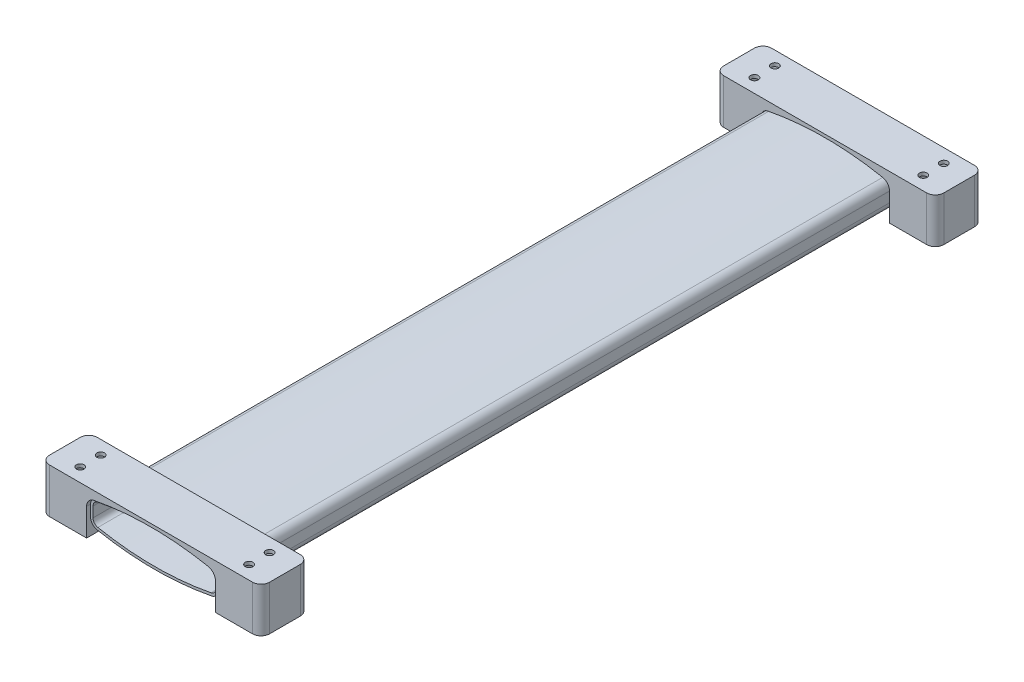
ISO-10303-21;
HEADER;
FILE_DESCRIPTION(('STEP AP214'),'2;1');
FILE_NAME('part.step','',(''),(''),'','','');
FILE_SCHEMA(('AUTOMOTIVE_DESIGN { 1 0 10303 214 1 1 1 1 }'));
ENDSEC;
DATA;
#1=APPLICATION_CONTEXT('core data for automotive mechanical design processes');
#2=APPLICATION_PROTOCOL_DEFINITION('international standard','automotive_design',2000,#1);
#3=PRODUCT_CONTEXT('',#1,'mechanical');
#4=PRODUCT('Part','Part','',(#3));
#5=PRODUCT_RELATED_PRODUCT_CATEGORY('part','',(#4));
#6=PRODUCT_DEFINITION_FORMATION('','',#4);
#7=PRODUCT_DEFINITION_CONTEXT('part definition',#1,'design');
#8=PRODUCT_DEFINITION('design','',#6,#7);
#9=PRODUCT_DEFINITION_SHAPE('','',#8);
#10=(LENGTH_UNIT() NAMED_UNIT(*) SI_UNIT(.MILLI.,.METRE.));
#11=(NAMED_UNIT(*) PLANE_ANGLE_UNIT() SI_UNIT($,.RADIAN.));
#12=(NAMED_UNIT(*) SI_UNIT($,.STERADIAN.) SOLID_ANGLE_UNIT());
#13=UNCERTAINTY_MEASURE_WITH_UNIT(LENGTH_MEASURE(1.E-05),#10,'distance_accuracy_value','');
#14=(GEOMETRIC_REPRESENTATION_CONTEXT(3) GLOBAL_UNCERTAINTY_ASSIGNED_CONTEXT((#13)) GLOBAL_UNIT_ASSIGNED_CONTEXT((#10,
#11,#12)) REPRESENTATION_CONTEXT('',''));
#15=CARTESIAN_POINT('',(0.,0.,0.));
#16=DIRECTION('',(0.,0.,1.));
#17=DIRECTION('',(1.,0.,0.));
#18=AXIS2_PLACEMENT_3D('',#15,#16,#17);
#19=CARTESIAN_POINT('',(-49.5,13.125,401.2));
#20=DIRECTION('',(0.,-1.,0.));
#21=DIRECTION('',(0.,0.,1.));
#22=AXIS2_PLACEMENT_3D('',#19,#20,#21);
#23=CYLINDRICAL_SURFACE('',#22,2.25);
#24=CARTESIAN_POINT('',(-49.5,13.125,401.2));
#25=DIRECTION('',(0.,1.,0.));
#26=DIRECTION('',(0.,0.,1.));
#27=AXIS2_PLACEMENT_3D('',#24,#25,#26);
#28=CIRCLE('',#27,2.25);
#29=CARTESIAN_POINT('',(-49.5,13.125,403.45));
#30=VERTEX_POINT('',#29);
#31=EDGE_CURVE('E344',#30,#30,#28,.T.);
#32=ORIENTED_EDGE('',*,*,#31,.T.);
#33=EDGE_LOOP('',(#32));
#34=FACE_BOUND('',#33,.T.);
#35=CARTESIAN_POINT('',(-49.5,11.125,401.2));
#36=DIRECTION('',(0.,-1.,0.));
#37=DIRECTION('',(0.,0.,-1.));
#38=AXIS2_PLACEMENT_3D('',#35,#36,#37);
#39=CIRCLE('',#38,2.25);
#40=CARTESIAN_POINT('',(-49.5,11.125,398.95));
#41=VERTEX_POINT('',#40);
#42=EDGE_CURVE('E315',#41,#41,#39,.F.);
#43=ORIENTED_EDGE('',*,*,#42,.F.);
#44=EDGE_LOOP('',(#43));
#45=FACE_BOUND('',#44,.T.);
#46=ADVANCED_FACE('F50',(#34,#45),#23,.F.);
#47=CARTESIAN_POINT('',(-49.5,13.125,413.2));
#48=DIRECTION('',(0.,-1.,0.));
#49=DIRECTION('',(0.,0.,1.));
#50=AXIS2_PLACEMENT_3D('',#47,#48,#49);
#51=CYLINDRICAL_SURFACE('',#50,2.25);
#52=CARTESIAN_POINT('',(-49.5,13.125,413.2));
#53=DIRECTION('',(0.,1.,0.));
#54=DIRECTION('',(0.,0.,1.));
#55=AXIS2_PLACEMENT_3D('',#52,#53,#54);
#56=CIRCLE('',#55,2.25);
#57=CARTESIAN_POINT('',(-49.5,13.125,415.45));
#58=VERTEX_POINT('',#57);
#59=EDGE_CURVE('E347',#58,#58,#56,.T.);
#60=ORIENTED_EDGE('',*,*,#59,.T.);
#61=EDGE_LOOP('',(#60));
#62=FACE_BOUND('',#61,.T.);
#63=CARTESIAN_POINT('',(-49.5,11.125,413.2));
#64=DIRECTION('',(0.,-1.,0.));
#65=DIRECTION('',(0.,0.,-1.));
#66=AXIS2_PLACEMENT_3D('',#63,#64,#65);
#67=CIRCLE('',#66,2.25);
#68=CARTESIAN_POINT('',(-49.5,11.125,410.95));
#69=VERTEX_POINT('',#68);
#70=EDGE_CURVE('E54',#69,#69,#67,.F.);
#71=ORIENTED_EDGE('',*,*,#70,.F.);
#72=EDGE_LOOP('',(#71));
#73=FACE_BOUND('',#72,.T.);
#74=ADVANCED_FACE('F466',(#62,#73),#51,.F.);
#75=CARTESIAN_POINT('',(49.5,13.125,401.2));
#76=DIRECTION('',(0.,-1.,0.));
#77=DIRECTION('',(0.,0.,1.));
#78=AXIS2_PLACEMENT_3D('',#75,#76,#77);
#79=CYLINDRICAL_SURFACE('',#78,2.25);
#80=CARTESIAN_POINT('',(49.5,13.125,401.2));
#81=DIRECTION('',(0.,-1.,0.));
#82=DIRECTION('',(0.,0.,1.));
#83=AXIS2_PLACEMENT_3D('',#80,#81,#82);
#84=CIRCLE('',#83,2.25);
#85=CARTESIAN_POINT('',(49.5,13.125,403.45));
#86=VERTEX_POINT('',#85);
#87=EDGE_CURVE('E340',#86,#86,#84,.T.);
#88=ORIENTED_EDGE('',*,*,#87,.F.);
#89=EDGE_LOOP('',(#88));
#90=FACE_BOUND('',#89,.T.);
#91=CARTESIAN_POINT('',(49.5,11.125,401.2));
#92=DIRECTION('',(0.,-1.,0.));
#93=DIRECTION('',(0.,0.,-1.));
#94=AXIS2_PLACEMENT_3D('',#91,#92,#93);
#95=CIRCLE('',#94,2.25);
#96=CARTESIAN_POINT('',(49.5,11.125,398.95));
#97=VERTEX_POINT('',#96);
#98=EDGE_CURVE('E312',#97,#97,#95,.T.);
#99=ORIENTED_EDGE('',*,*,#98,.T.);
#100=EDGE_LOOP('',(#99));
#101=FACE_BOUND('',#100,.T.);
#102=ADVANCED_FACE('F472',(#90,#101),#79,.F.);
#103=CARTESIAN_POINT('',(49.5,13.125,413.2));
#104=DIRECTION('',(0.,-1.,0.));
#105=DIRECTION('',(0.,0.,1.));
#106=AXIS2_PLACEMENT_3D('',#103,#104,#105);
#107=CYLINDRICAL_SURFACE('',#106,2.25);
#108=CARTESIAN_POINT('',(49.5,13.125,413.2));
#109=DIRECTION('',(0.,-1.,0.));
#110=DIRECTION('',(0.,0.,1.));
#111=AXIS2_PLACEMENT_3D('',#108,#109,#110);
#112=CIRCLE('',#111,2.25);
#113=CARTESIAN_POINT('',(49.5,13.125,415.45));
#114=VERTEX_POINT('',#113);
#115=EDGE_CURVE('E341',#114,#114,#112,.T.);
#116=ORIENTED_EDGE('',*,*,#115,.F.);
#117=EDGE_LOOP('',(#116));
#118=FACE_BOUND('',#117,.T.);
#119=CARTESIAN_POINT('',(49.5,11.125,413.2));
#120=DIRECTION('',(0.,-1.,0.));
#121=DIRECTION('',(0.,0.,-1.));
#122=AXIS2_PLACEMENT_3D('',#119,#120,#121);
#123=CIRCLE('',#122,2.25);
#124=CARTESIAN_POINT('',(49.5,11.125,410.95));
#125=VERTEX_POINT('',#124);
#126=EDGE_CURVE('E270',#125,#125,#123,.T.);
#127=ORIENTED_EDGE('',*,*,#126,.T.);
#128=EDGE_LOOP('',(#127));
#129=FACE_BOUND('',#128,.T.);
#130=ADVANCED_FACE('F436',(#118,#129),#107,.F.);
#131=CARTESIAN_POINT('',(64.5,-13.125,393.2));
#132=DIRECTION('',(0.,0.,-1.));
#133=DIRECTION('',(1.,0.,0.));
#134=AXIS2_PLACEMENT_3D('',#131,#132,#133);
#135=PLANE('',#134);
#136=CARTESIAN_POINT('',(0.,-163.875,393.2));
#137=DIRECTION('',(0.,0.,-1.));
#138=DIRECTION('',(-1.,0.,0.));
#139=AXIS2_PLACEMENT_3D('',#136,#137,#138);
#140=CIRCLE('',#139,175.25);
#141=CARTESIAN_POINT('',(-33.5036764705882,8.14263329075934,393.2));
#142=VERTEX_POINT('',#141);
#143=CARTESIAN_POINT('',(33.5036764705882,8.14263329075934,393.2));
#144=VERTEX_POINT('',#143);
#145=EDGE_CURVE('E334',#142,#144,#140,.T.);
#146=ORIENTED_EDGE('',*,*,#145,.F.);
#147=CARTESIAN_POINT('',(-32.5,2.98946595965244,393.2));
#148=DIRECTION('',(0.,0.,-1.));
#149=DIRECTION('',(-1.,0.,0.));
#150=AXIS2_PLACEMENT_3D('',#147,#148,#149);
#151=CIRCLE('',#150,5.25);
#152=CARTESIAN_POINT('',(-37.75,2.98946595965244,393.2));
#153=VERTEX_POINT('',#152);
#154=EDGE_CURVE('E59',#142,#153,#151,.F.);
#155=ORIENTED_EDGE('',*,*,#154,.T.);
#156=DIRECTION('',(0.,1.,0.));
#157=VECTOR('',#156,1.);
#158=CARTESIAN_POINT('',(-37.75,-13.125,393.2));
#159=LINE('',#158,#157);
#160=CARTESIAN_POINT('',(-37.75,-13.125,393.2));
#161=VERTEX_POINT('',#160);
#162=EDGE_CURVE('E337',#161,#153,#159,.T.);
#163=ORIENTED_EDGE('',*,*,#162,.F.);
#164=DIRECTION('',(1.,0.,0.));
#165=VECTOR('',#164,1.);
#166=CARTESIAN_POINT('',(64.5,-13.125,393.2));
#167=LINE('',#166,#165);
#168=CARTESIAN_POINT('',(-59.5,-13.125,393.2));
#169=VERTEX_POINT('',#168);
#170=EDGE_CURVE('E358',#169,#161,#167,.T.);
#171=ORIENTED_EDGE('',*,*,#170,.F.);
#172=DIRECTION('',(0.,1.,0.));
#173=VECTOR('',#172,1.);
#174=CARTESIAN_POINT('',(-59.5,-13.125,393.2));
#175=LINE('',#174,#173);
#176=CARTESIAN_POINT('',(-59.5,13.125,393.2));
#177=VERTEX_POINT('',#176);
#178=EDGE_CURVE('E396',#177,#169,#175,.F.);
#179=ORIENTED_EDGE('',*,*,#178,.F.);
#180=DIRECTION('',(1.,0.,0.));
#181=VECTOR('',#180,1.);
#182=CARTESIAN_POINT('',(64.5,13.125,393.2));
#183=LINE('',#182,#181);
#184=CARTESIAN_POINT('',(59.5,13.125,393.2));
#185=VERTEX_POINT('',#184);
#186=EDGE_CURVE('E371',#177,#185,#183,.T.);
#187=ORIENTED_EDGE('',*,*,#186,.T.);
#188=DIRECTION('',(0.,1.,0.));
#189=VECTOR('',#188,1.);
#190=CARTESIAN_POINT('',(59.5,-13.125,393.2));
#191=LINE('',#190,#189);
#192=CARTESIAN_POINT('',(59.5,-13.125,393.2));
#193=VERTEX_POINT('',#192);
#194=EDGE_CURVE('E393',#193,#185,#191,.T.);
#195=ORIENTED_EDGE('',*,*,#194,.F.);
#196=CARTESIAN_POINT('',(37.75,-13.125,393.2));
#197=VERTEX_POINT('',#196);
#198=EDGE_CURVE('E356',#197,#193,#167,.T.);
#199=ORIENTED_EDGE('',*,*,#198,.F.);
#200=DIRECTION('',(0.,-1.,0.));
#201=VECTOR('',#200,1.);
#202=CARTESIAN_POINT('',(37.75,-13.125,393.2));
#203=LINE('',#202,#201);
#204=CARTESIAN_POINT('',(37.75,2.98946595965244,393.2));
#205=VERTEX_POINT('',#204);
#206=EDGE_CURVE('E332',#205,#197,#203,.T.);
#207=ORIENTED_EDGE('',*,*,#206,.F.);
#208=CARTESIAN_POINT('',(32.5,2.98946595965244,393.2));
#209=DIRECTION('',(0.,0.,-1.));
#210=DIRECTION('',(-1.,0.,0.));
#211=AXIS2_PLACEMENT_3D('',#208,#209,#210);
#212=CIRCLE('',#211,5.25);
#213=EDGE_CURVE('E429',#205,#144,#212,.F.);
#214=ORIENTED_EDGE('',*,*,#213,.T.);
#215=EDGE_LOOP('',(#146,#155,#163,#171,#179,#187,#195,#199,#207,#214));
#216=FACE_BOUND('',#215,.T.);
#217=ADVANCED_FACE('F481',(#216),#135,.T.);
#218=CARTESIAN_POINT('',(0.,-13.125,419.2));
#219=DIRECTION('',(0.,-1.,0.));
#220=DIRECTION('',(0.,0.,1.));
#221=AXIS2_PLACEMENT_3D('',#218,#219,#220);
#222=PLANE('',#221);
#223=CARTESIAN_POINT('',(-59.5,-13.125,398.2));
#224=DIRECTION('',(0.,-1.,0.));
#225=DIRECTION('',(0.,0.,-1.));
#226=AXIS2_PLACEMENT_3D('',#223,#224,#225);
#227=CIRCLE('',#226,3.);
#228=CARTESIAN_POINT('',(-62.5,-13.125,398.2));
#229=VERTEX_POINT('',#228);
#230=CARTESIAN_POINT('',(-59.5,-13.125,395.2));
#231=VERTEX_POINT('',#230);
#232=EDGE_CURVE('E67',#229,#231,#227,.T.);
#233=ORIENTED_EDGE('',*,*,#232,.F.);
#234=DIRECTION('',(0.,0.,-1.));
#235=VECTOR('',#234,1.);
#236=CARTESIAN_POINT('',(-62.5,-13.125,416.2));
#237=LINE('',#236,#235);
#238=CARTESIAN_POINT('',(-62.5,-13.125,416.2));
#239=VERTEX_POINT('',#238);
#240=EDGE_CURVE('E297',#239,#229,#237,.T.);
#241=ORIENTED_EDGE('',*,*,#240,.F.);
#242=CARTESIAN_POINT('',(-59.5,-13.125,416.2));
#243=DIRECTION('',(0.,-1.,0.));
#244=DIRECTION('',(0.,0.,-1.));
#245=AXIS2_PLACEMENT_3D('',#242,#243,#244);
#246=CIRCLE('',#245,3.);
#247=CARTESIAN_POINT('',(-59.5,-13.125,419.2));
#248=VERTEX_POINT('',#247);
#249=EDGE_CURVE('E294',#248,#239,#246,.T.);
#250=ORIENTED_EDGE('',*,*,#249,.F.);
#251=DIRECTION('',(-1.,0.,0.));
#252=VECTOR('',#251,1.);
#253=CARTESIAN_POINT('',(-39.75,-13.125,419.2));
#254=LINE('',#253,#252);
#255=CARTESIAN_POINT('',(-39.75,-13.125,419.2));
#256=VERTEX_POINT('',#255);
#257=EDGE_CURVE('E291',#256,#248,#254,.T.);
#258=ORIENTED_EDGE('',*,*,#257,.F.);
#259=DIRECTION('',(0.,0.,1.));
#260=VECTOR('',#259,1.);
#261=CARTESIAN_POINT('',(-39.75,-13.125,395.2));
#262=LINE('',#261,#260);
#263=CARTESIAN_POINT('',(-39.75,-13.125,395.2));
#264=VERTEX_POINT('',#263);
#265=EDGE_CURVE('E288',#264,#256,#262,.T.);
#266=ORIENTED_EDGE('',*,*,#265,.F.);
#267=DIRECTION('',(1.,0.,0.));
#268=VECTOR('',#267,1.);
#269=CARTESIAN_POINT('',(-59.5,-13.125,395.2));
#270=LINE('',#269,#268);
#271=EDGE_CURVE('E285',#231,#264,#270,.T.);
#272=ORIENTED_EDGE('',*,*,#271,.F.);
#273=EDGE_LOOP('',(#233,#241,#250,#258,#266,#272));
#274=FACE_BOUND('',#273,.T.);
#275=ORIENTED_EDGE('',*,*,#170,.T.);
#276=DIRECTION('',(0.,0.,1.));
#277=VECTOR('',#276,1.);
#278=CARTESIAN_POINT('',(-37.75,-13.125,419.2));
#279=LINE('',#278,#277);
#280=CARTESIAN_POINT('',(-37.75,-13.125,421.2));
#281=VERTEX_POINT('',#280);
#282=EDGE_CURVE('E321',#161,#281,#279,.T.);
#283=ORIENTED_EDGE('',*,*,#282,.T.);
#284=DIRECTION('',(-1.,0.,0.));
#285=VECTOR('',#284,1.);
#286=CARTESIAN_POINT('',(64.5,-13.125,421.2));
#287=LINE('',#286,#285);
#288=CARTESIAN_POINT('',(-59.5,-13.125,421.2));
#289=VERTEX_POINT('',#288);
#290=EDGE_CURVE('E364',#281,#289,#287,.T.);
#291=ORIENTED_EDGE('',*,*,#290,.T.);
#292=CARTESIAN_POINT('',(-59.5,-13.125,416.2));
#293=DIRECTION('',(0.,1.,0.));
#294=DIRECTION('',(0.,0.,1.));
#295=AXIS2_PLACEMENT_3D('',#292,#293,#294);
#296=CIRCLE('',#295,5.);
#297=CARTESIAN_POINT('',(-64.5,-13.125,416.2));
#298=VERTEX_POINT('',#297);
#299=EDGE_CURVE('E404',#298,#289,#296,.T.);
#300=ORIENTED_EDGE('',*,*,#299,.F.);
#301=DIRECTION('',(0.,0.,-1.));
#302=VECTOR('',#301,1.);
#303=CARTESIAN_POINT('',(-64.5,-13.125,421.2));
#304=LINE('',#303,#302);
#305=CARTESIAN_POINT('',(-64.5,-13.125,398.2));
#306=VERTEX_POINT('',#305);
#307=EDGE_CURVE('E353',#298,#306,#304,.T.);
#308=ORIENTED_EDGE('',*,*,#307,.T.);
#309=CARTESIAN_POINT('',(-59.5,-13.125,398.2));
#310=DIRECTION('',(0.,1.,0.));
#311=DIRECTION('',(0.,0.,1.));
#312=AXIS2_PLACEMENT_3D('',#309,#310,#311);
#313=CIRCLE('',#312,5.);
#314=EDGE_CURVE('E407',#169,#306,#313,.T.);
#315=ORIENTED_EDGE('',*,*,#314,.F.);
#316=EDGE_LOOP('',(#275,#283,#291,#300,#308,#315));
#317=FACE_BOUND('',#316,.T.);
#318=ADVANCED_FACE('F478',(#274,#317),#222,.T.);
#319=CARTESIAN_POINT('',(59.5,-13.125,416.2));
#320=DIRECTION('',(0.,-1.,0.));
#321=DIRECTION('',(0.,0.,-1.));
#322=AXIS2_PLACEMENT_3D('',#319,#320,#321);
#323=CIRCLE('',#322,3.);
#324=CARTESIAN_POINT('',(62.5,-13.125,416.2));
#325=VERTEX_POINT('',#324);
#326=CARTESIAN_POINT('',(59.5,-13.125,419.2));
#327=VERTEX_POINT('',#326);
#328=EDGE_CURVE('E75',#325,#327,#323,.T.);
#329=ORIENTED_EDGE('',*,*,#328,.F.);
#330=DIRECTION('',(0.,0.,1.));
#331=VECTOR('',#330,1.);
#332=CARTESIAN_POINT('',(62.5,-13.125,398.2));
#333=LINE('',#332,#331);
#334=CARTESIAN_POINT('',(62.5,-13.125,398.2));
#335=VERTEX_POINT('',#334);
#336=EDGE_CURVE('E257',#335,#325,#333,.T.);
#337=ORIENTED_EDGE('',*,*,#336,.F.);
#338=CARTESIAN_POINT('',(59.5,-13.125,398.2));
#339=DIRECTION('',(0.,-1.,0.));
#340=DIRECTION('',(0.,0.,-1.));
#341=AXIS2_PLACEMENT_3D('',#338,#339,#340);
#342=CIRCLE('',#341,3.);
#343=CARTESIAN_POINT('',(59.5,-13.125,395.2));
#344=VERTEX_POINT('',#343);
#345=EDGE_CURVE('E251',#344,#335,#342,.T.);
#346=ORIENTED_EDGE('',*,*,#345,.F.);
#347=DIRECTION('',(1.,0.,0.));
#348=VECTOR('',#347,1.);
#349=CARTESIAN_POINT('',(39.75,-13.125,395.2));
#350=LINE('',#349,#348);
#351=CARTESIAN_POINT('',(39.75,-13.125,395.2));
#352=VERTEX_POINT('',#351);
#353=EDGE_CURVE('E249',#352,#344,#350,.T.);
#354=ORIENTED_EDGE('',*,*,#353,.F.);
#355=DIRECTION('',(0.,0.,-1.));
#356=VECTOR('',#355,1.);
#357=CARTESIAN_POINT('',(39.75,-13.125,419.2));
#358=LINE('',#357,#356);
#359=CARTESIAN_POINT('',(39.75,-13.125,419.2));
#360=VERTEX_POINT('',#359);
#361=EDGE_CURVE('E231',#360,#352,#358,.T.);
#362=ORIENTED_EDGE('',*,*,#361,.F.);
#363=DIRECTION('',(-1.,0.,0.));
#364=VECTOR('',#363,1.);
#365=CARTESIAN_POINT('',(59.5,-13.125,419.2));
#366=LINE('',#365,#364);
#367=EDGE_CURVE('E241',#327,#360,#366,.T.);
#368=ORIENTED_EDGE('',*,*,#367,.F.);
#369=EDGE_LOOP('',(#329,#337,#346,#354,#362,#368));
#370=FACE_BOUND('',#369,.T.);
#371=CARTESIAN_POINT('',(59.5,-13.125,421.2));
#372=VERTEX_POINT('',#371);
#373=CARTESIAN_POINT('',(37.75,-13.125,421.2));
#374=VERTEX_POINT('',#373);
#375=EDGE_CURVE('E365',#372,#374,#287,.T.);
#376=ORIENTED_EDGE('',*,*,#375,.T.);
#377=DIRECTION('',(0.,0.,-1.));
#378=VECTOR('',#377,1.);
#379=CARTESIAN_POINT('',(37.75,-13.125,419.2));
#380=LINE('',#379,#378);
#381=EDGE_CURVE('E318',#374,#197,#380,.T.);
#382=ORIENTED_EDGE('',*,*,#381,.T.);
#383=ORIENTED_EDGE('',*,*,#198,.T.);
#384=CARTESIAN_POINT('',(59.5,-13.125,398.2));
#385=DIRECTION('',(0.,1.,0.));
#386=DIRECTION('',(0.,0.,1.));
#387=AXIS2_PLACEMENT_3D('',#384,#385,#386);
#388=CIRCLE('',#387,5.);
#389=CARTESIAN_POINT('',(64.5,-13.125,398.2));
#390=VERTEX_POINT('',#389);
#391=EDGE_CURVE('E399',#390,#193,#388,.T.);
#392=ORIENTED_EDGE('',*,*,#391,.F.);
#393=DIRECTION('',(0.,0.,1.));
#394=VECTOR('',#393,1.);
#395=CARTESIAN_POINT('',(64.5,-13.125,393.2));
#396=LINE('',#395,#394);
#397=CARTESIAN_POINT('',(64.5,-13.125,416.2));
#398=VERTEX_POINT('',#397);
#399=EDGE_CURVE('E361',#390,#398,#396,.T.);
#400=ORIENTED_EDGE('',*,*,#399,.T.);
#401=CARTESIAN_POINT('',(59.5,-13.125,416.2));
#402=DIRECTION('',(0.,1.,0.));
#403=DIRECTION('',(0.,0.,1.));
#404=AXIS2_PLACEMENT_3D('',#401,#402,#403);
#405=CIRCLE('',#404,5.);
#406=EDGE_CURVE('E402',#372,#398,#405,.T.);
#407=ORIENTED_EDGE('',*,*,#406,.F.);
#408=EDGE_LOOP('',(#376,#382,#383,#392,#400,#407));
#409=FACE_BOUND('',#408,.T.);
#410=ADVANCED_FACE('F245',(#370,#409),#222,.T.);
#411=CARTESIAN_POINT('',(32.5,2.98946595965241,421.2));
#412=DIRECTION('',(0.,0.,1.));
#413=DIRECTION('',(-1.,0.,0.));
#414=AXIS2_PLACEMENT_3D('',#411,#412,#413);
#415=PLANE('',#414);
#416=ORIENTED_EDGE('',*,*,#290,.F.);
#417=DIRECTION('',(0.,-1.,0.));
#418=VECTOR('',#417,1.);
#419=CARTESIAN_POINT('',(-37.75,2.98946595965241,421.2));
#420=LINE('',#419,#418);
#421=CARTESIAN_POINT('',(-37.75,2.98946595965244,421.2));
#422=VERTEX_POINT('',#421);
#423=EDGE_CURVE('E330',#422,#281,#420,.T.);
#424=ORIENTED_EDGE('',*,*,#423,.F.);
#425=CARTESIAN_POINT('',(-32.5,2.98946595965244,421.2));
#426=DIRECTION('',(0.,0.,1.));
#427=DIRECTION('',(1.,0.,0.));
#428=AXIS2_PLACEMENT_3D('',#425,#426,#427);
#429=CIRCLE('',#428,5.25);
#430=CARTESIAN_POINT('',(-33.5036764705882,8.14263329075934,421.2));
#431=VERTEX_POINT('',#430);
#432=EDGE_CURVE('E13',#422,#431,#429,.F.);
#433=ORIENTED_EDGE('',*,*,#432,.T.);
#434=CARTESIAN_POINT('',(0.,-163.875,421.2));
#435=DIRECTION('',(0.,0.,1.));
#436=DIRECTION('',(1.,0.,0.));
#437=AXIS2_PLACEMENT_3D('',#434,#435,#436);
#438=CIRCLE('',#437,175.25);
#439=CARTESIAN_POINT('',(33.5036764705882,8.14263329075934,421.2));
#440=VERTEX_POINT('',#439);
#441=EDGE_CURVE('E327',#440,#431,#438,.T.);
#442=ORIENTED_EDGE('',*,*,#441,.F.);
#443=CARTESIAN_POINT('',(32.5,2.98946595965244,421.2));
#444=DIRECTION('',(0.,0.,1.));
#445=DIRECTION('',(1.,0.,0.));
#446=AXIS2_PLACEMENT_3D('',#443,#444,#445);
#447=CIRCLE('',#446,5.25);
#448=CARTESIAN_POINT('',(37.75,2.98946595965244,421.2));
#449=VERTEX_POINT('',#448);
#450=EDGE_CURVE('E431',#440,#449,#447,.F.);
#451=ORIENTED_EDGE('',*,*,#450,.T.);
#452=DIRECTION('',(0.,1.,0.));
#453=VECTOR('',#452,1.);
#454=CARTESIAN_POINT('',(37.75,-2.98946595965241,421.2));
#455=LINE('',#454,#453);
#456=EDGE_CURVE('E324',#374,#449,#455,.T.);
#457=ORIENTED_EDGE('',*,*,#456,.F.);
#458=ORIENTED_EDGE('',*,*,#375,.F.);
#459=DIRECTION('',(0.,1.,0.));
#460=VECTOR('',#459,1.);
#461=CARTESIAN_POINT('',(59.5,2.98946595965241,421.2));
#462=LINE('',#461,#460);
#463=CARTESIAN_POINT('',(59.5,13.125,421.2));
#464=VERTEX_POINT('',#463);
#465=EDGE_CURVE('E409',#464,#372,#462,.F.);
#466=ORIENTED_EDGE('',*,*,#465,.F.);
#467=DIRECTION('',(-1.,0.,0.));
#468=VECTOR('',#467,1.);
#469=CARTESIAN_POINT('',(64.5,13.125,421.2));
#470=LINE('',#469,#468);
#471=CARTESIAN_POINT('',(-59.5,13.125,421.2));
#472=VERTEX_POINT('',#471);
#473=EDGE_CURVE('E357',#464,#472,#470,.T.);
#474=ORIENTED_EDGE('',*,*,#473,.T.);
#475=DIRECTION('',(0.,1.,0.));
#476=VECTOR('',#475,1.);
#477=CARTESIAN_POINT('',(-59.5,2.98946595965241,421.2));
#478=LINE('',#477,#476);
#479=EDGE_CURVE('E411',#289,#472,#478,.T.);
#480=ORIENTED_EDGE('',*,*,#479,.F.);
#481=EDGE_LOOP('',(#416,#424,#433,#442,#451,#457,#458,#466,#474,#480));
#482=FACE_BOUND('',#481,.T.);
#483=ADVANCED_FACE('F498',(#482),#415,.T.);
#484=CARTESIAN_POINT('',(-64.5,-13.125,421.2));
#485=DIRECTION('',(-1.,0.,0.));
#486=DIRECTION('',(0.,0.,-1.));
#487=AXIS2_PLACEMENT_3D('',#484,#485,#486);
#488=PLANE('',#487);
#489=ORIENTED_EDGE('',*,*,#307,.F.);
#490=DIRECTION('',(0.,1.,0.));
#491=VECTOR('',#490,1.);
#492=CARTESIAN_POINT('',(-64.5,-13.125,416.2));
#493=LINE('',#492,#491);
#494=CARTESIAN_POINT('',(-64.5,13.125,416.2));
#495=VERTEX_POINT('',#494);
#496=EDGE_CURVE('E368',#495,#298,#493,.F.);
#497=ORIENTED_EDGE('',*,*,#496,.F.);
#498=DIRECTION('',(0.,0.,-1.));
#499=VECTOR('',#498,1.);
#500=CARTESIAN_POINT('',(-64.5,13.125,421.2));
#501=LINE('',#500,#499);
#502=CARTESIAN_POINT('',(-64.5,13.125,398.2));
#503=VERTEX_POINT('',#502);
#504=EDGE_CURVE('E350',#495,#503,#501,.T.);
#505=ORIENTED_EDGE('',*,*,#504,.T.);
#506=DIRECTION('',(0.,1.,0.));
#507=VECTOR('',#506,1.);
#508=CARTESIAN_POINT('',(-64.5,-13.125,398.2));
#509=LINE('',#508,#507);
#510=EDGE_CURVE('E381',#306,#503,#509,.T.);
#511=ORIENTED_EDGE('',*,*,#510,.F.);
#512=EDGE_LOOP('',(#489,#497,#505,#511));
#513=FACE_BOUND('',#512,.T.);
#514=ADVANCED_FACE('F491',(#513),#488,.T.);
#515=CARTESIAN_POINT('',(64.5,-13.125,393.2));
#516=DIRECTION('',(1.,0.,0.));
#517=DIRECTION('',(0.,0.,1.));
#518=AXIS2_PLACEMENT_3D('',#515,#516,#517);
#519=PLANE('',#518);
#520=ORIENTED_EDGE('',*,*,#399,.F.);
#521=DIRECTION('',(0.,1.,0.));
#522=VECTOR('',#521,1.);
#523=CARTESIAN_POINT('',(64.5,-13.125,398.2));
#524=LINE('',#523,#522);
#525=CARTESIAN_POINT('',(64.5,13.125,398.2));
#526=VERTEX_POINT('',#525);
#527=EDGE_CURVE('E413',#526,#390,#524,.F.);
#528=ORIENTED_EDGE('',*,*,#527,.F.);
#529=DIRECTION('',(0.,0.,1.));
#530=VECTOR('',#529,1.);
#531=CARTESIAN_POINT('',(64.5,13.125,393.2));
#532=LINE('',#531,#530);
#533=CARTESIAN_POINT('',(64.5,13.125,416.2));
#534=VERTEX_POINT('',#533);
#535=EDGE_CURVE('E374',#526,#534,#532,.T.);
#536=ORIENTED_EDGE('',*,*,#535,.T.);
#537=DIRECTION('',(0.,1.,0.));
#538=VECTOR('',#537,1.);
#539=CARTESIAN_POINT('',(64.5,-13.125,416.2));
#540=LINE('',#539,#538);
#541=EDGE_CURVE('E416',#398,#534,#540,.T.);
#542=ORIENTED_EDGE('',*,*,#541,.F.);
#543=EDGE_LOOP('',(#520,#528,#536,#542));
#544=FACE_BOUND('',#543,.T.);
#545=ADVANCED_FACE('F487',(#544),#519,.T.);
#546=CARTESIAN_POINT('',(0.,13.125,419.2));
#547=DIRECTION('',(0.,-1.,0.));
#548=DIRECTION('',(0.,0.,1.));
#549=AXIS2_PLACEMENT_3D('',#546,#547,#548);
#550=PLANE('',#549);
#551=ORIENTED_EDGE('',*,*,#115,.T.);
#552=EDGE_LOOP('',(#551));
#553=FACE_BOUND('',#552,.T.);
#554=ORIENTED_EDGE('',*,*,#87,.T.);
#555=EDGE_LOOP('',(#554));
#556=FACE_BOUND('',#555,.T.);
#557=ORIENTED_EDGE('',*,*,#59,.F.);
#558=EDGE_LOOP('',(#557));
#559=FACE_BOUND('',#558,.T.);
#560=ORIENTED_EDGE('',*,*,#31,.F.);
#561=EDGE_LOOP('',(#560));
#562=FACE_BOUND('',#561,.T.);
#563=ORIENTED_EDGE('',*,*,#504,.F.);
#564=CARTESIAN_POINT('',(-59.5,13.125,416.2));
#565=DIRECTION('',(0.,1.,0.));
#566=DIRECTION('',(0.,0.,1.));
#567=AXIS2_PLACEMENT_3D('',#564,#565,#566);
#568=CIRCLE('',#567,5.);
#569=EDGE_CURVE('E389',#472,#495,#568,.F.);
#570=ORIENTED_EDGE('',*,*,#569,.F.);
#571=ORIENTED_EDGE('',*,*,#473,.F.);
#572=CARTESIAN_POINT('',(59.5,13.125,416.2));
#573=DIRECTION('',(0.,1.,0.));
#574=DIRECTION('',(0.,0.,1.));
#575=AXIS2_PLACEMENT_3D('',#572,#573,#574);
#576=CIRCLE('',#575,5.);
#577=EDGE_CURVE('E386',#534,#464,#576,.F.);
#578=ORIENTED_EDGE('',*,*,#577,.F.);
#579=ORIENTED_EDGE('',*,*,#535,.F.);
#580=CARTESIAN_POINT('',(59.5,13.125,398.2));
#581=DIRECTION('',(0.,1.,0.));
#582=DIRECTION('',(0.,0.,1.));
#583=AXIS2_PLACEMENT_3D('',#580,#581,#582);
#584=CIRCLE('',#583,5.);
#585=EDGE_CURVE('E384',#185,#526,#584,.F.);
#586=ORIENTED_EDGE('',*,*,#585,.F.);
#587=ORIENTED_EDGE('',*,*,#186,.F.);
#588=CARTESIAN_POINT('',(-59.5,13.125,398.2));
#589=DIRECTION('',(0.,1.,0.));
#590=DIRECTION('',(0.,0.,1.));
#591=AXIS2_PLACEMENT_3D('',#588,#589,#590);
#592=CIRCLE('',#591,5.);
#593=EDGE_CURVE('E391',#503,#177,#592,.F.);
#594=ORIENTED_EDGE('',*,*,#593,.F.);
#595=EDGE_LOOP('',(#563,#570,#571,#578,#579,#586,#587,#594));
#596=FACE_BOUND('',#595,.T.);
#597=ADVANCED_FACE('F483',(#553,#556,#559,#562,#596),#550,.F.);
#598=CARTESIAN_POINT('',(-59.5,-13.125,398.2));
#599=DIRECTION('',(0.,1.,0.));
#600=DIRECTION('',(0.,0.,-1.));
#601=AXIS2_PLACEMENT_3D('',#598,#599,#600);
#602=CYLINDRICAL_SURFACE('',#601,5.);
#603=ORIENTED_EDGE('',*,*,#314,.T.);
#604=ORIENTED_EDGE('',*,*,#510,.T.);
#605=ORIENTED_EDGE('',*,*,#593,.T.);
#606=ORIENTED_EDGE('',*,*,#178,.T.);
#607=EDGE_LOOP('',(#603,#604,#605,#606));
#608=FACE_BOUND('',#607,.T.);
#609=ADVANCED_FACE('F486',(#608),#602,.T.);
#610=CARTESIAN_POINT('',(-59.5,2.98946595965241,416.2));
#611=DIRECTION('',(0.,1.,0.));
#612=DIRECTION('',(0.,0.,-1.));
#613=AXIS2_PLACEMENT_3D('',#610,#611,#612);
#614=CYLINDRICAL_SURFACE('',#613,5.);
#615=ORIENTED_EDGE('',*,*,#299,.T.);
#616=ORIENTED_EDGE('',*,*,#479,.T.);
#617=ORIENTED_EDGE('',*,*,#569,.T.);
#618=ORIENTED_EDGE('',*,*,#496,.T.);
#619=EDGE_LOOP('',(#615,#616,#617,#618));
#620=FACE_BOUND('',#619,.T.);
#621=ADVANCED_FACE('F505',(#620),#614,.T.);
#622=CARTESIAN_POINT('',(59.5,-13.125,416.2));
#623=DIRECTION('',(0.,1.,0.));
#624=DIRECTION('',(0.,0.,-1.));
#625=AXIS2_PLACEMENT_3D('',#622,#623,#624);
#626=CYLINDRICAL_SURFACE('',#625,5.);
#627=ORIENTED_EDGE('',*,*,#406,.T.);
#628=ORIENTED_EDGE('',*,*,#541,.T.);
#629=ORIENTED_EDGE('',*,*,#577,.T.);
#630=ORIENTED_EDGE('',*,*,#465,.T.);
#631=EDGE_LOOP('',(#627,#628,#629,#630));
#632=FACE_BOUND('',#631,.T.);
#633=ADVANCED_FACE('F509',(#632),#626,.T.);
#634=CARTESIAN_POINT('',(59.5,-13.125,398.2));
#635=DIRECTION('',(0.,1.,0.));
#636=DIRECTION('',(0.,0.,-1.));
#637=AXIS2_PLACEMENT_3D('',#634,#635,#636);
#638=CYLINDRICAL_SURFACE('',#637,5.);
#639=ORIENTED_EDGE('',*,*,#391,.T.);
#640=ORIENTED_EDGE('',*,*,#194,.T.);
#641=ORIENTED_EDGE('',*,*,#585,.T.);
#642=ORIENTED_EDGE('',*,*,#527,.T.);
#643=EDGE_LOOP('',(#639,#640,#641,#642));
#644=FACE_BOUND('',#643,.T.);
#645=ADVANCED_FACE('F513',(#644),#638,.T.);
#646=CARTESIAN_POINT('',(-37.75,2.98946595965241,-2.));
#647=DIRECTION('',(-1.,0.,0.));
#648=DIRECTION('',(0.,0.,1.));
#649=AXIS2_PLACEMENT_3D('',#646,#647,#648);
#650=PLANE('',#649);
#651=ORIENTED_EDGE('',*,*,#162,.T.);
#652=DIRECTION('',(0.,0.,-1.));
#653=VECTOR('',#652,1.);
#654=CARTESIAN_POINT('',(-37.75,2.98946595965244,421.2));
#655=LINE('',#654,#653);
#656=EDGE_CURVE('E427',#153,#422,#655,.F.);
#657=ORIENTED_EDGE('',*,*,#656,.T.);
#658=ORIENTED_EDGE('',*,*,#423,.T.);
#659=ORIENTED_EDGE('',*,*,#282,.F.);
#660=EDGE_LOOP('',(#651,#657,#658,#659));
#661=FACE_BOUND('',#660,.T.);
#662=ADVANCED_FACE('F516',(#661),#650,.F.);
#663=CARTESIAN_POINT('',(0.,-163.875,-2.));
#664=DIRECTION('',(0.,0.,1.));
#665=DIRECTION('',(1.,0.,0.));
#666=AXIS2_PLACEMENT_3D('',#663,#664,#665);
#667=CYLINDRICAL_SURFACE('',#666,175.25);
#668=ORIENTED_EDGE('',*,*,#145,.T.);
#669=DIRECTION('',(0.,0.,1.));
#670=VECTOR('',#669,1.);
#671=CARTESIAN_POINT('',(33.5036764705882,8.14263329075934,-2.));
#672=LINE('',#671,#670);
#673=EDGE_CURVE('E425',#144,#440,#672,.T.);
#674=ORIENTED_EDGE('',*,*,#673,.T.);
#675=ORIENTED_EDGE('',*,*,#441,.T.);
#676=DIRECTION('',(0.,0.,1.));
#677=VECTOR('',#676,1.);
#678=CARTESIAN_POINT('',(-33.5036764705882,8.14263329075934,-2.));
#679=LINE('',#678,#677);
#680=EDGE_CURVE('E422',#431,#142,#679,.F.);
#681=ORIENTED_EDGE('',*,*,#680,.T.);
#682=EDGE_LOOP('',(#668,#674,#675,#681));
#683=FACE_BOUND('',#682,.T.);
#684=ADVANCED_FACE('F524',(#683),#667,.F.);
#685=CARTESIAN_POINT('',(37.75,-2.98946595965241,-2.));
#686=DIRECTION('',(1.,0.,0.));
#687=DIRECTION('',(0.,0.,-1.));
#688=AXIS2_PLACEMENT_3D('',#685,#686,#687);
#689=PLANE('',#688);
#690=ORIENTED_EDGE('',*,*,#456,.T.);
#691=DIRECTION('',(0.,0.,-1.));
#692=VECTOR('',#691,1.);
#693=CARTESIAN_POINT('',(37.75,2.98946595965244,393.2));
#694=LINE('',#693,#692);
#695=EDGE_CURVE('E419',#449,#205,#694,.T.);
#696=ORIENTED_EDGE('',*,*,#695,.T.);
#697=ORIENTED_EDGE('',*,*,#206,.T.);
#698=ORIENTED_EDGE('',*,*,#381,.F.);
#699=EDGE_LOOP('',(#690,#696,#697,#698));
#700=FACE_BOUND('',#699,.T.);
#701=ADVANCED_FACE('F519',(#700),#689,.F.);
#702=CARTESIAN_POINT('',(32.5,2.98946595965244,-2.));
#703=DIRECTION('',(0.,0.,1.));
#704=DIRECTION('',(1.,0.,0.));
#705=AXIS2_PLACEMENT_3D('',#702,#703,#704);
#706=CYLINDRICAL_SURFACE('',#705,5.25);
#707=ORIENTED_EDGE('',*,*,#450,.F.);
#708=ORIENTED_EDGE('',*,*,#673,.F.);
#709=ORIENTED_EDGE('',*,*,#213,.F.);
#710=ORIENTED_EDGE('',*,*,#695,.F.);
#711=EDGE_LOOP('',(#707,#708,#709,#710));
#712=FACE_BOUND('',#711,.T.);
#713=ADVANCED_FACE('F461',(#712),#706,.F.);
#714=CARTESIAN_POINT('',(-32.5,2.98946595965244,-2.));
#715=DIRECTION('',(0.,0.,1.));
#716=DIRECTION('',(1.,0.,0.));
#717=AXIS2_PLACEMENT_3D('',#714,#715,#716);
#718=CYLINDRICAL_SURFACE('',#717,5.25);
#719=ORIENTED_EDGE('',*,*,#432,.F.);
#720=ORIENTED_EDGE('',*,*,#656,.F.);
#721=ORIENTED_EDGE('',*,*,#154,.F.);
#722=ORIENTED_EDGE('',*,*,#680,.F.);
#723=EDGE_LOOP('',(#719,#720,#721,#722));
#724=FACE_BOUND('',#723,.T.);
#725=ADVANCED_FACE('F52',(#724),#718,.F.);
#726=CARTESIAN_POINT('',(59.5,46.1940565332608,416.2));
#727=DIRECTION('',(0.,-1.,0.));
#728=DIRECTION('',(0.,0.,-1.));
#729=AXIS2_PLACEMENT_3D('',#726,#727,#728);
#730=CYLINDRICAL_SURFACE('',#729,3.);
#731=CARTESIAN_POINT('',(59.5,11.125,416.2));
#732=DIRECTION('',(0.,-1.,0.));
#733=DIRECTION('',(0.,0.,-1.));
#734=AXIS2_PLACEMENT_3D('',#731,#732,#733);
#735=CIRCLE('',#734,3.);
#736=CARTESIAN_POINT('',(59.5,11.125,419.2));
#737=VERTEX_POINT('',#736);
#738=CARTESIAN_POINT('',(62.5,11.125,416.2));
#739=VERTEX_POINT('',#738);
#740=EDGE_CURVE('E271',#737,#739,#735,.F.);
#741=ORIENTED_EDGE('',*,*,#740,.T.);
#742=DIRECTION('',(0.,-1.,0.));
#743=VECTOR('',#742,1.);
#744=CARTESIAN_POINT('',(62.5,46.1940565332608,416.2));
#745=LINE('',#744,#743);
#746=EDGE_CURVE('E260',#739,#325,#745,.T.);
#747=ORIENTED_EDGE('',*,*,#746,.T.);
#748=ORIENTED_EDGE('',*,*,#328,.T.);
#749=DIRECTION('',(0.,-1.,0.));
#750=VECTOR('',#749,1.);
#751=CARTESIAN_POINT('',(59.5,46.1940565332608,419.2));
#752=LINE('',#751,#750);
#753=EDGE_CURVE('E238',#737,#327,#752,.T.);
#754=ORIENTED_EDGE('',*,*,#753,.F.);
#755=EDGE_LOOP('',(#741,#747,#748,#754));
#756=FACE_BOUND('',#755,.T.);
#757=ADVANCED_FACE('F450',(#756),#730,.F.);
#758=CARTESIAN_POINT('',(62.5,46.1940565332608,398.2));
#759=DIRECTION('',(1.,0.,0.));
#760=DIRECTION('',(0.,0.,-1.));
#761=AXIS2_PLACEMENT_3D('',#758,#759,#760);
#762=PLANE('',#761);
#763=DIRECTION('',(0.,0.,-1.));
#764=VECTOR('',#763,1.);
#765=CARTESIAN_POINT('',(62.5,11.125,398.2));
#766=LINE('',#765,#764);
#767=CARTESIAN_POINT('',(62.5,11.125,398.2));
#768=VERTEX_POINT('',#767);
#769=EDGE_CURVE('E447',#739,#768,#766,.T.);
#770=ORIENTED_EDGE('',*,*,#769,.T.);
#771=DIRECTION('',(0.,-1.,0.));
#772=VECTOR('',#771,1.);
#773=CARTESIAN_POINT('',(62.5,46.1940565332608,398.2));
#774=LINE('',#773,#772);
#775=EDGE_CURVE('E262',#768,#335,#774,.T.);
#776=ORIENTED_EDGE('',*,*,#775,.T.);
#777=ORIENTED_EDGE('',*,*,#336,.T.);
#778=ORIENTED_EDGE('',*,*,#746,.F.);
#779=EDGE_LOOP('',(#770,#776,#777,#778));
#780=FACE_BOUND('',#779,.T.);
#781=ADVANCED_FACE('F452',(#780),#762,.F.);
#782=CARTESIAN_POINT('',(59.5,46.1940565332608,398.2));
#783=DIRECTION('',(0.,-1.,0.));
#784=DIRECTION('',(0.,0.,-1.));
#785=AXIS2_PLACEMENT_3D('',#782,#783,#784);
#786=CYLINDRICAL_SURFACE('',#785,3.);
#787=CARTESIAN_POINT('',(59.5,11.125,398.2));
#788=DIRECTION('',(0.,-1.,0.));
#789=DIRECTION('',(0.,0.,-1.));
#790=AXIS2_PLACEMENT_3D('',#787,#788,#789);
#791=CIRCLE('',#790,3.);
#792=CARTESIAN_POINT('',(59.5,11.125,395.2));
#793=VERTEX_POINT('',#792);
#794=EDGE_CURVE('E853',#768,#793,#791,.F.);
#795=ORIENTED_EDGE('',*,*,#794,.T.);
#796=DIRECTION('',(0.,-1.,0.));
#797=VECTOR('',#796,1.);
#798=CARTESIAN_POINT('',(59.5,46.1940565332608,395.2));
#799=LINE('',#798,#797);
#800=EDGE_CURVE('E264',#793,#344,#799,.T.);
#801=ORIENTED_EDGE('',*,*,#800,.T.);
#802=ORIENTED_EDGE('',*,*,#345,.T.);
#803=ORIENTED_EDGE('',*,*,#775,.F.);
#804=EDGE_LOOP('',(#795,#801,#802,#803));
#805=FACE_BOUND('',#804,.T.);
#806=ADVANCED_FACE('F458',(#805),#786,.F.);
#807=CARTESIAN_POINT('',(39.75,46.1940565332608,395.2));
#808=DIRECTION('',(0.,0.,-1.));
#809=DIRECTION('',(-1.,0.,0.));
#810=AXIS2_PLACEMENT_3D('',#807,#808,#809);
#811=PLANE('',#810);
#812=DIRECTION('',(-1.,0.,0.));
#813=VECTOR('',#812,1.);
#814=CARTESIAN_POINT('',(39.75,11.125,395.2));
#815=LINE('',#814,#813);
#816=CARTESIAN_POINT('',(39.75,11.125,395.2));
#817=VERTEX_POINT('',#816);
#818=EDGE_CURVE('E856',#793,#817,#815,.T.);
#819=ORIENTED_EDGE('',*,*,#818,.T.);
#820=DIRECTION('',(0.,-1.,0.));
#821=VECTOR('',#820,1.);
#822=CARTESIAN_POINT('',(39.75,46.1940565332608,395.2));
#823=LINE('',#822,#821);
#824=EDGE_CURVE('E237',#817,#352,#823,.T.);
#825=ORIENTED_EDGE('',*,*,#824,.T.);
#826=ORIENTED_EDGE('',*,*,#353,.T.);
#827=ORIENTED_EDGE('',*,*,#800,.F.);
#828=EDGE_LOOP('',(#819,#825,#826,#827));
#829=FACE_BOUND('',#828,.T.);
#830=ADVANCED_FACE('F680',(#829),#811,.F.);
#831=CARTESIAN_POINT('',(39.75,46.1940565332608,419.2));
#832=DIRECTION('',(-1.,0.,0.));
#833=DIRECTION('',(0.,0.,1.));
#834=AXIS2_PLACEMENT_3D('',#831,#832,#833);
#835=PLANE('',#834);
#836=DIRECTION('',(0.,0.,1.));
#837=VECTOR('',#836,1.);
#838=CARTESIAN_POINT('',(39.75,11.125,419.2));
#839=LINE('',#838,#837);
#840=CARTESIAN_POINT('',(39.75,11.125,419.2));
#841=VERTEX_POINT('',#840);
#842=EDGE_CURVE('E234',#817,#841,#839,.T.);
#843=ORIENTED_EDGE('',*,*,#842,.T.);
#844=DIRECTION('',(0.,-1.,0.));
#845=VECTOR('',#844,1.);
#846=CARTESIAN_POINT('',(39.75,46.1940565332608,419.2));
#847=LINE('',#846,#845);
#848=EDGE_CURVE('E226',#841,#360,#847,.T.);
#849=ORIENTED_EDGE('',*,*,#848,.T.);
#850=ORIENTED_EDGE('',*,*,#361,.T.);
#851=ORIENTED_EDGE('',*,*,#824,.F.);
#852=EDGE_LOOP('',(#843,#849,#850,#851));
#853=FACE_BOUND('',#852,.T.);
#854=ADVANCED_FACE('F228',(#853),#835,.F.);
#855=CARTESIAN_POINT('',(59.5,46.1940565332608,419.2));
#856=DIRECTION('',(0.,0.,1.));
#857=DIRECTION('',(1.,0.,0.));
#858=AXIS2_PLACEMENT_3D('',#855,#856,#857);
#859=PLANE('',#858);
#860=DIRECTION('',(1.,0.,0.));
#861=VECTOR('',#860,1.);
#862=CARTESIAN_POINT('',(59.5,11.125,419.2));
#863=LINE('',#862,#861);
#864=EDGE_CURVE('E268',#841,#737,#863,.T.);
#865=ORIENTED_EDGE('',*,*,#864,.T.);
#866=ORIENTED_EDGE('',*,*,#753,.T.);
#867=ORIENTED_EDGE('',*,*,#367,.T.);
#868=ORIENTED_EDGE('',*,*,#848,.F.);
#869=EDGE_LOOP('',(#865,#866,#867,#868));
#870=FACE_BOUND('',#869,.T.);
#871=ADVANCED_FACE('F242',(#870),#859,.F.);
#872=CARTESIAN_POINT('',(0.,11.125,419.2));
#873=DIRECTION('',(0.,-1.,0.));
#874=DIRECTION('',(0.,0.,1.));
#875=AXIS2_PLACEMENT_3D('',#872,#873,#874);
#876=PLANE('',#875);
#877=ORIENTED_EDGE('',*,*,#98,.F.);
#878=EDGE_LOOP('',(#877));
#879=FACE_BOUND('',#878,.T.);
#880=ORIENTED_EDGE('',*,*,#126,.F.);
#881=EDGE_LOOP('',(#880));
#882=FACE_BOUND('',#881,.T.);
#883=ORIENTED_EDGE('',*,*,#740,.F.);
#884=ORIENTED_EDGE('',*,*,#864,.F.);
#885=ORIENTED_EDGE('',*,*,#842,.F.);
#886=ORIENTED_EDGE('',*,*,#818,.F.);
#887=ORIENTED_EDGE('',*,*,#794,.F.);
#888=ORIENTED_EDGE('',*,*,#769,.F.);
#889=EDGE_LOOP('',(#883,#884,#885,#886,#887,#888));
#890=FACE_BOUND('',#889,.T.);
#891=ADVANCED_FACE('F438',(#879,#882,#890),#876,.T.);
#892=CARTESIAN_POINT('',(0.,11.125,419.2));
#893=DIRECTION('',(0.,-1.,0.));
#894=DIRECTION('',(0.,0.,1.));
#895=AXIS2_PLACEMENT_3D('',#892,#893,#894);
#896=PLANE('',#895);
#897=CARTESIAN_POINT('',(-59.5,11.125,398.2));
#898=DIRECTION('',(0.,-1.,0.));
#899=DIRECTION('',(0.,0.,-1.));
#900=AXIS2_PLACEMENT_3D('',#897,#898,#899);
#901=CIRCLE('',#900,3.);
#902=CARTESIAN_POINT('',(-59.5,11.125,395.2));
#903=VERTEX_POINT('',#902);
#904=CARTESIAN_POINT('',(-62.5,11.125,398.2));
#905=VERTEX_POINT('',#904);
#906=EDGE_CURVE('E281',#903,#905,#901,.F.);
#907=ORIENTED_EDGE('',*,*,#906,.F.);
#908=DIRECTION('',(-1.,0.,0.));
#909=VECTOR('',#908,1.);
#910=CARTESIAN_POINT('',(-59.5,11.125,395.2));
#911=LINE('',#910,#909);
#912=CARTESIAN_POINT('',(-39.75,11.125,395.2));
#913=VERTEX_POINT('',#912);
#914=EDGE_CURVE('E283',#913,#903,#911,.T.);
#915=ORIENTED_EDGE('',*,*,#914,.F.);
#916=DIRECTION('',(0.,0.,-1.));
#917=VECTOR('',#916,1.);
#918=CARTESIAN_POINT('',(-39.75,11.125,395.2));
#919=LINE('',#918,#917);
#920=CARTESIAN_POINT('',(-39.75,11.125,419.2));
#921=VERTEX_POINT('',#920);
#922=EDGE_CURVE('E272',#921,#913,#919,.T.);
#923=ORIENTED_EDGE('',*,*,#922,.F.);
#924=DIRECTION('',(1.,0.,0.));
#925=VECTOR('',#924,1.);
#926=CARTESIAN_POINT('',(-39.75,11.125,419.2));
#927=LINE('',#926,#925);
#928=CARTESIAN_POINT('',(-59.5,11.125,419.2));
#929=VERTEX_POINT('',#928);
#930=EDGE_CURVE('E274',#929,#921,#927,.T.);
#931=ORIENTED_EDGE('',*,*,#930,.F.);
#932=CARTESIAN_POINT('',(-59.5,11.125,416.2));
#933=DIRECTION('',(0.,-1.,0.));
#934=DIRECTION('',(0.,0.,-1.));
#935=AXIS2_PLACEMENT_3D('',#932,#933,#934);
#936=CIRCLE('',#935,3.);
#937=CARTESIAN_POINT('',(-62.5,11.125,416.2));
#938=VERTEX_POINT('',#937);
#939=EDGE_CURVE('E277',#938,#929,#936,.F.);
#940=ORIENTED_EDGE('',*,*,#939,.F.);
#941=DIRECTION('',(0.,0.,1.));
#942=VECTOR('',#941,1.);
#943=CARTESIAN_POINT('',(-62.5,11.125,416.2));
#944=LINE('',#943,#942);
#945=EDGE_CURVE('E279',#905,#938,#944,.T.);
#946=ORIENTED_EDGE('',*,*,#945,.F.);
#947=EDGE_LOOP('',(#907,#915,#923,#931,#940,#946));
#948=FACE_BOUND('',#947,.T.);
#949=ORIENTED_EDGE('',*,*,#70,.T.);
#950=EDGE_LOOP('',(#949));
#951=FACE_BOUND('',#950,.T.);
#952=ORIENTED_EDGE('',*,*,#42,.T.);
#953=EDGE_LOOP('',(#952));
#954=FACE_BOUND('',#953,.T.);
#955=ADVANCED_FACE('F441',(#948,#951,#954),#896,.T.);
#956=CARTESIAN_POINT('',(-59.5,46.1940565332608,398.2));
#957=DIRECTION('',(0.,-1.,0.));
#958=DIRECTION('',(0.,0.,-1.));
#959=AXIS2_PLACEMENT_3D('',#956,#957,#958);
#960=CYLINDRICAL_SURFACE('',#959,3.);
#961=ORIENTED_EDGE('',*,*,#906,.T.);
#962=DIRECTION('',(0.,-1.,0.));
#963=VECTOR('',#962,1.);
#964=CARTESIAN_POINT('',(-62.5,46.1940565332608,398.2));
#965=LINE('',#964,#963);
#966=EDGE_CURVE('E275',#905,#229,#965,.T.);
#967=ORIENTED_EDGE('',*,*,#966,.T.);
#968=ORIENTED_EDGE('',*,*,#232,.T.);
#969=DIRECTION('',(0.,-1.,0.));
#970=VECTOR('',#969,1.);
#971=CARTESIAN_POINT('',(-59.5,46.1940565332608,395.2));
#972=LINE('',#971,#970);
#973=EDGE_CURVE('E300',#903,#231,#972,.T.);
#974=ORIENTED_EDGE('',*,*,#973,.F.);
#975=EDGE_LOOP('',(#961,#967,#968,#974));
#976=FACE_BOUND('',#975,.T.);
#977=ADVANCED_FACE('F590',(#976),#960,.F.);
#978=CARTESIAN_POINT('',(-62.5,46.1940565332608,416.2));
#979=DIRECTION('',(-1.,0.,0.));
#980=DIRECTION('',(0.,0.,1.));
#981=AXIS2_PLACEMENT_3D('',#978,#979,#980);
#982=PLANE('',#981);
#983=ORIENTED_EDGE('',*,*,#945,.T.);
#984=DIRECTION('',(0.,-1.,0.));
#985=VECTOR('',#984,1.);
#986=CARTESIAN_POINT('',(-62.5,46.1940565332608,416.2));
#987=LINE('',#986,#985);
#988=EDGE_CURVE('E302',#938,#239,#987,.T.);
#989=ORIENTED_EDGE('',*,*,#988,.T.);
#990=ORIENTED_EDGE('',*,*,#240,.T.);
#991=ORIENTED_EDGE('',*,*,#966,.F.);
#992=EDGE_LOOP('',(#983,#989,#990,#991));
#993=FACE_BOUND('',#992,.T.);
#994=ADVANCED_FACE('F596',(#993),#982,.F.);
#995=CARTESIAN_POINT('',(-59.5,46.1940565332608,416.2));
#996=DIRECTION('',(0.,-1.,0.));
#997=DIRECTION('',(0.,0.,-1.));
#998=AXIS2_PLACEMENT_3D('',#995,#996,#997);
#999=CYLINDRICAL_SURFACE('',#998,3.);
#1000=ORIENTED_EDGE('',*,*,#939,.T.);
#1001=DIRECTION('',(0.,-1.,0.));
#1002=VECTOR('',#1001,1.);
#1003=CARTESIAN_POINT('',(-59.5,46.1940565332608,419.2));
#1004=LINE('',#1003,#1002);
#1005=EDGE_CURVE('E304',#929,#248,#1004,.T.);
#1006=ORIENTED_EDGE('',*,*,#1005,.T.);
#1007=ORIENTED_EDGE('',*,*,#249,.T.);
#1008=ORIENTED_EDGE('',*,*,#988,.F.);
#1009=EDGE_LOOP('',(#1000,#1006,#1007,#1008));
#1010=FACE_BOUND('',#1009,.T.);
#1011=ADVANCED_FACE('F601',(#1010),#999,.F.);
#1012=CARTESIAN_POINT('',(-39.75,46.1940565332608,419.2));
#1013=DIRECTION('',(0.,0.,1.));
#1014=DIRECTION('',(1.,0.,0.));
#1015=AXIS2_PLACEMENT_3D('',#1012,#1013,#1014);
#1016=PLANE('',#1015);
#1017=ORIENTED_EDGE('',*,*,#930,.T.);
#1018=DIRECTION('',(0.,-1.,0.));
#1019=VECTOR('',#1018,1.);
#1020=CARTESIAN_POINT('',(-39.75,46.1940565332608,419.2));
#1021=LINE('',#1020,#1019);
#1022=EDGE_CURVE('E306',#921,#256,#1021,.T.);
#1023=ORIENTED_EDGE('',*,*,#1022,.T.);
#1024=ORIENTED_EDGE('',*,*,#257,.T.);
#1025=ORIENTED_EDGE('',*,*,#1005,.F.);
#1026=EDGE_LOOP('',(#1017,#1023,#1024,#1025));
#1027=FACE_BOUND('',#1026,.T.);
#1028=ADVANCED_FACE('F605',(#1027),#1016,.F.);
#1029=CARTESIAN_POINT('',(-39.75,46.1940565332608,395.2));
#1030=DIRECTION('',(1.,0.,0.));
#1031=DIRECTION('',(0.,0.,-1.));
#1032=AXIS2_PLACEMENT_3D('',#1029,#1030,#1031);
#1033=PLANE('',#1032);
#1034=ORIENTED_EDGE('',*,*,#922,.T.);
#1035=DIRECTION('',(0.,-1.,0.));
#1036=VECTOR('',#1035,1.);
#1037=CARTESIAN_POINT('',(-39.75,46.1940565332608,395.2));
#1038=LINE('',#1037,#1036);
#1039=EDGE_CURVE('E308',#913,#264,#1038,.T.);
#1040=ORIENTED_EDGE('',*,*,#1039,.T.);
#1041=ORIENTED_EDGE('',*,*,#265,.T.);
#1042=ORIENTED_EDGE('',*,*,#1022,.F.);
#1043=EDGE_LOOP('',(#1034,#1040,#1041,#1042));
#1044=FACE_BOUND('',#1043,.T.);
#1045=ADVANCED_FACE('F609',(#1044),#1033,.F.);
#1046=CARTESIAN_POINT('',(-59.5,46.1940565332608,395.2));
#1047=DIRECTION('',(0.,0.,-1.));
#1048=DIRECTION('',(-1.,0.,0.));
#1049=AXIS2_PLACEMENT_3D('',#1046,#1047,#1048);
#1050=PLANE('',#1049);
#1051=ORIENTED_EDGE('',*,*,#914,.T.);
#1052=ORIENTED_EDGE('',*,*,#973,.T.);
#1053=ORIENTED_EDGE('',*,*,#271,.T.);
#1054=ORIENTED_EDGE('',*,*,#1039,.F.);
#1055=EDGE_LOOP('',(#1051,#1052,#1053,#1054));
#1056=FACE_BOUND('',#1055,.T.);
#1057=ADVANCED_FACE('F613',(#1056),#1050,.F.);
#1058=CLOSED_SHELL('',(#46,#74,#102,#130,#217,#318,#410,#483,#514,#545,#597,#609,#621,#633,#645,
#662,#684,#701,#713,#725,#757,#781,#806,#830,#854,#871,#891,#955,#977,#994,#1011,#1028,#1045,#1057));
#1059=MANIFOLD_SOLID_BREP('B2',#1058);
#1060=CARTESIAN_POINT('',(0.,-163.875,421.2));
#1061=DIRECTION('',(0.,0.,-1.));
#1062=DIRECTION('',(-1.,0.,0.));
#1063=AXIS2_PLACEMENT_3D('',#1060,#1061,#1062);
#1064=CYLINDRICAL_SURFACE('',#1063,175.25);
#1065=DIRECTION('',(0.,0.,-1.));
#1066=VECTOR('',#1065,1.);
#1067=CARTESIAN_POINT('',(-33.5036764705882,8.14263329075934,421.2));
#1068=LINE('',#1067,#1066);
#1069=CARTESIAN_POINT('',(-33.5036764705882,8.14263329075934,26.));
#1070=VERTEX_POINT('',#1069);
#1071=CARTESIAN_POINT('',(-33.5036764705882,8.14263329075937,0.));
#1072=VERTEX_POINT('',#1071);
#1073=EDGE_CURVE('E1171',#1070,#1072,#1068,.T.);
#1074=ORIENTED_EDGE('',*,*,#1073,.T.);
#1075=CARTESIAN_POINT('',(0.,-163.875,0.));
#1076=DIRECTION('',(0.,0.,-1.));
#1077=DIRECTION('',(-1.,0.,0.));
#1078=AXIS2_PLACEMENT_3D('',#1075,#1076,#1077);
#1079=CIRCLE('',#1078,175.25);
#1080=CARTESIAN_POINT('',(33.5036764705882,8.14263329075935,0.));
#1081=VERTEX_POINT('',#1080);
#1082=EDGE_CURVE('E1358',#1072,#1081,#1079,.T.);
#1083=ORIENTED_EDGE('',*,*,#1082,.T.);
#1084=DIRECTION('',(0.,0.,-1.));
#1085=VECTOR('',#1084,1.);
#1086=CARTESIAN_POINT('',(33.5036764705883,8.14263329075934,421.2));
#1087=LINE('',#1086,#1085);
#1088=CARTESIAN_POINT('',(33.5036764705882,8.14263329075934,26.));
#1089=VERTEX_POINT('',#1088);
#1090=EDGE_CURVE('E1169',#1081,#1089,#1087,.F.);
#1091=ORIENTED_EDGE('',*,*,#1090,.T.);
#1092=CARTESIAN_POINT('',(0.,-163.875,26.));
#1093=DIRECTION('',(0.,0.,1.));
#1094=DIRECTION('',(1.,0.,0.));
#1095=AXIS2_PLACEMENT_3D('',#1092,#1093,#1094);
#1096=CIRCLE('',#1095,175.25);
#1097=EDGE_CURVE('E1089',#1070,#1089,#1096,.F.);
#1098=ORIENTED_EDGE('',*,*,#1097,.F.);
#1099=EDGE_LOOP('',(#1074,#1083,#1091,#1098));
#1100=FACE_BOUND('',#1099,.T.);
#1101=ADVANCED_FACE('F886',(#1100),#1064,.F.);
#1102=CARTESIAN_POINT('',(-37.75,-19.5552183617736,421.2));
#1103=DIRECTION('',(1.,0.,0.));
#1104=DIRECTION('',(0.,0.,-1.));
#1105=AXIS2_PLACEMENT_3D('',#1102,#1103,#1104);
#1106=PLANE('',#1105);
#1107=DIRECTION('',(0.,0.,1.));
#1108=VECTOR('',#1107,1.);
#1109=CARTESIAN_POINT('',(-37.75,-13.125,0.));
#1110=LINE('',#1109,#1108);
#1111=CARTESIAN_POINT('',(-37.75,-13.125,0.));
#1112=VERTEX_POINT('',#1111);
#1113=CARTESIAN_POINT('',(-37.75,-13.125,26.));
#1114=VERTEX_POINT('',#1113);
#1115=EDGE_CURVE('E1078',#1112,#1114,#1110,.T.);
#1116=ORIENTED_EDGE('',*,*,#1115,.F.);
#1117=DIRECTION('',(0.,1.,0.));
#1118=VECTOR('',#1117,1.);
#1119=CARTESIAN_POINT('',(-37.75,2.98946595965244,0.));
#1120=LINE('',#1119,#1118);
#1121=CARTESIAN_POINT('',(-37.75,2.98946595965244,0.));
#1122=VERTEX_POINT('',#1121);
#1123=EDGE_CURVE('E1061',#1112,#1122,#1120,.T.);
#1124=ORIENTED_EDGE('',*,*,#1123,.T.);
#1125=DIRECTION('',(0.,0.,1.));
#1126=VECTOR('',#1125,1.);
#1127=CARTESIAN_POINT('',(-37.75,2.98946595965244,26.));
#1128=LINE('',#1127,#1126);
#1129=CARTESIAN_POINT('',(-37.75,2.98946595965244,26.));
#1130=VERTEX_POINT('',#1129);
#1131=EDGE_CURVE('E1174',#1122,#1130,#1128,.T.);
#1132=ORIENTED_EDGE('',*,*,#1131,.T.);
#1133=DIRECTION('',(0.,1.,0.));
#1134=VECTOR('',#1133,1.);
#1135=CARTESIAN_POINT('',(-37.75,-13.125,26.));
#1136=LINE('',#1135,#1134);
#1137=EDGE_CURVE('E1085',#1114,#1130,#1136,.T.);
#1138=ORIENTED_EDGE('',*,*,#1137,.F.);
#1139=EDGE_LOOP('',(#1116,#1124,#1132,#1138));
#1140=FACE_BOUND('',#1139,.T.);
#1141=ADVANCED_FACE('F1083',(#1140),#1106,.T.);
#1142=CARTESIAN_POINT('',(37.75,0.,421.2));
#1143=DIRECTION('',(-1.,0.,0.));
#1144=DIRECTION('',(0.,0.,1.));
#1145=AXIS2_PLACEMENT_3D('',#1142,#1143,#1144);
#1146=PLANE('',#1145);
#1147=DIRECTION('',(0.,0.,1.));
#1148=VECTOR('',#1147,1.);
#1149=CARTESIAN_POINT('',(37.75,2.98946595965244,-2.));
#1150=LINE('',#1149,#1148);
#1151=CARTESIAN_POINT('',(37.75,2.98946595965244,26.));
#1152=VERTEX_POINT('',#1151);
#1153=CARTESIAN_POINT('',(37.75,2.98946595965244,0.));
#1154=VERTEX_POINT('',#1153);
#1155=EDGE_CURVE('E1176',#1152,#1154,#1150,.F.);
#1156=ORIENTED_EDGE('',*,*,#1155,.T.);
#1157=DIRECTION('',(0.,-1.,0.));
#1158=VECTOR('',#1157,1.);
#1159=CARTESIAN_POINT('',(37.75,-13.125,0.));
#1160=LINE('',#1159,#1158);
#1161=CARTESIAN_POINT('',(37.75,-13.125,0.));
#1162=VERTEX_POINT('',#1161);
#1163=EDGE_CURVE('E1213',#1154,#1162,#1160,.T.);
#1164=ORIENTED_EDGE('',*,*,#1163,.T.);
#1165=DIRECTION('',(0.,0.,-1.));
#1166=VECTOR('',#1165,1.);
#1167=CARTESIAN_POINT('',(37.75,-13.125,0.));
#1168=LINE('',#1167,#1166);
#1169=CARTESIAN_POINT('',(37.75,-13.125,26.));
#1170=VERTEX_POINT('',#1169);
#1171=EDGE_CURVE('E1081',#1170,#1162,#1168,.T.);
#1172=ORIENTED_EDGE('',*,*,#1171,.F.);
#1173=DIRECTION('',(0.,-1.,0.));
#1174=VECTOR('',#1173,1.);
#1175=CARTESIAN_POINT('',(37.75,-13.125,26.));
#1176=LINE('',#1175,#1174);
#1177=EDGE_CURVE('E1087',#1152,#1170,#1176,.T.);
#1178=ORIENTED_EDGE('',*,*,#1177,.F.);
#1179=EDGE_LOOP('',(#1156,#1164,#1172,#1178));
#1180=FACE_BOUND('',#1179,.T.);
#1181=ADVANCED_FACE('F1272',(#1180),#1146,.T.);
#1182=CARTESIAN_POINT('',(-32.5,2.98946595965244,421.2));
#1183=DIRECTION('',(0.,0.,-1.));
#1184=DIRECTION('',(-1.,0.,0.));
#1185=AXIS2_PLACEMENT_3D('',#1182,#1183,#1184);
#1186=CYLINDRICAL_SURFACE('',#1185,5.25);
#1187=CARTESIAN_POINT('',(-32.5,2.98946595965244,0.));
#1188=DIRECTION('',(0.,0.,-1.));
#1189=DIRECTION('',(-1.,0.,0.));
#1190=AXIS2_PLACEMENT_3D('',#1187,#1188,#1189);
#1191=CIRCLE('',#1190,5.25);
#1192=EDGE_CURVE('E1067',#1122,#1072,#1191,.T.);
#1193=ORIENTED_EDGE('',*,*,#1192,.T.);
#1194=ORIENTED_EDGE('',*,*,#1073,.F.);
#1195=CARTESIAN_POINT('',(-32.5,2.98946595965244,26.));
#1196=DIRECTION('',(0.,0.,1.));
#1197=DIRECTION('',(1.,0.,0.));
#1198=AXIS2_PLACEMENT_3D('',#1195,#1196,#1197);
#1199=CIRCLE('',#1198,5.25);
#1200=EDGE_CURVE('E895',#1130,#1070,#1199,.F.);
#1201=ORIENTED_EDGE('',*,*,#1200,.F.);
#1202=ORIENTED_EDGE('',*,*,#1131,.F.);
#1203=EDGE_LOOP('',(#1193,#1194,#1201,#1202));
#1204=FACE_BOUND('',#1203,.T.);
#1205=ADVANCED_FACE('F1347',(#1204),#1186,.F.);
#1206=CARTESIAN_POINT('',(32.5,2.98946595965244,421.2));
#1207=DIRECTION('',(0.,0.,-1.));
#1208=DIRECTION('',(-1.,0.,0.));
#1209=AXIS2_PLACEMENT_3D('',#1206,#1207,#1208);
#1210=CYLINDRICAL_SURFACE('',#1209,5.25);
#1211=CARTESIAN_POINT('',(32.5,2.98946595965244,0.));
#1212=DIRECTION('',(0.,0.,-1.));
#1213=DIRECTION('',(-1.,0.,0.));
#1214=AXIS2_PLACEMENT_3D('',#1211,#1212,#1213);
#1215=CIRCLE('',#1214,5.25);
#1216=EDGE_CURVE('E1367',#1081,#1154,#1215,.T.);
#1217=ORIENTED_EDGE('',*,*,#1216,.T.);
#1218=ORIENTED_EDGE('',*,*,#1155,.F.);
#1219=CARTESIAN_POINT('',(32.5,2.98946595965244,26.));
#1220=DIRECTION('',(0.,0.,1.));
#1221=DIRECTION('',(1.,0.,0.));
#1222=AXIS2_PLACEMENT_3D('',#1219,#1220,#1221);
#1223=CIRCLE('',#1222,5.25);
#1224=EDGE_CURVE('E48',#1089,#1152,#1223,.F.);
#1225=ORIENTED_EDGE('',*,*,#1224,.F.);
#1226=ORIENTED_EDGE('',*,*,#1090,.F.);
#1227=EDGE_LOOP('',(#1217,#1218,#1225,#1226));
#1228=FACE_BOUND('',#1227,.T.);
#1229=ADVANCED_FACE('F888',(#1228),#1210,.F.);
#1230=CARTESIAN_POINT('',(-49.5,13.125,18.));
#1231=DIRECTION('',(0.,-1.,0.));
#1232=DIRECTION('',(0.,0.,-1.));
#1233=AXIS2_PLACEMENT_3D('',#1230,#1231,#1232);
#1234=CYLINDRICAL_SURFACE('',#1233,2.25);
#1235=CARTESIAN_POINT('',(-49.5,13.125,18.));
#1236=DIRECTION('',(0.,-1.,0.));
#1237=DIRECTION('',(0.,0.,-1.));
#1238=AXIS2_PLACEMENT_3D('',#1235,#1236,#1237);
#1239=CIRCLE('',#1238,2.25);
#1240=CARTESIAN_POINT('',(-49.5,13.125,15.75));
#1241=VERTEX_POINT('',#1240);
#1242=EDGE_CURVE('E1100',#1241,#1241,#1239,.T.);
#1243=ORIENTED_EDGE('',*,*,#1242,.F.);
#1244=EDGE_LOOP('',(#1243));
#1245=FACE_BOUND('',#1244,.T.);
#1246=CARTESIAN_POINT('',(-49.5,11.125,18.));
#1247=DIRECTION('',(0.,-1.,0.));
#1248=DIRECTION('',(0.,0.,-1.));
#1249=AXIS2_PLACEMENT_3D('',#1246,#1247,#1248);
#1250=CIRCLE('',#1249,2.25);
#1251=CARTESIAN_POINT('',(-49.5,11.125,15.75));
#1252=VERTEX_POINT('',#1251);
#1253=EDGE_CURVE('E1240',#1252,#1252,#1250,.F.);
#1254=ORIENTED_EDGE('',*,*,#1253,.F.);
#1255=EDGE_LOOP('',(#1254));
#1256=FACE_BOUND('',#1255,.T.);
#1257=ADVANCED_FACE('F1252',(#1245,#1256),#1234,.F.);
#1258=CARTESIAN_POINT('',(-49.5,13.125,6.00000000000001));
#1259=DIRECTION('',(0.,-1.,0.));
#1260=DIRECTION('',(0.,0.,-1.));
#1261=AXIS2_PLACEMENT_3D('',#1258,#1259,#1260);
#1262=CYLINDRICAL_SURFACE('',#1261,2.25);
#1263=CARTESIAN_POINT('',(-49.5,13.125,6.00000000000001));
#1264=DIRECTION('',(0.,-1.,0.));
#1265=DIRECTION('',(0.,0.,-1.));
#1266=AXIS2_PLACEMENT_3D('',#1263,#1264,#1265);
#1267=CIRCLE('',#1266,2.25);
#1268=CARTESIAN_POINT('',(-49.5,13.125,3.75000000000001));
#1269=VERTEX_POINT('',#1268);
#1270=EDGE_CURVE('E1103',#1269,#1269,#1267,.T.);
#1271=ORIENTED_EDGE('',*,*,#1270,.F.);
#1272=EDGE_LOOP('',(#1271));
#1273=FACE_BOUND('',#1272,.T.);
#1274=CARTESIAN_POINT('',(-49.5,11.125,6.00000000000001));
#1275=DIRECTION('',(0.,-1.,0.));
#1276=DIRECTION('',(0.,0.,-1.));
#1277=AXIS2_PLACEMENT_3D('',#1274,#1275,#1276);
#1278=CIRCLE('',#1277,2.25);
#1279=CARTESIAN_POINT('',(-49.5,11.125,3.75000000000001));
#1280=VERTEX_POINT('',#1279);
#1281=EDGE_CURVE('E890',#1280,#1280,#1278,.F.);
#1282=ORIENTED_EDGE('',*,*,#1281,.F.);
#1283=EDGE_LOOP('',(#1282));
#1284=FACE_BOUND('',#1283,.T.);
#1285=ADVANCED_FACE('F1249',(#1273,#1284),#1262,.F.);
#1286=CARTESIAN_POINT('',(49.5,13.125,18.));
#1287=DIRECTION('',(0.,-1.,0.));
#1288=DIRECTION('',(0.,0.,-1.));
#1289=AXIS2_PLACEMENT_3D('',#1286,#1287,#1288);
#1290=CYLINDRICAL_SURFACE('',#1289,2.25);
#1291=CARTESIAN_POINT('',(49.5,13.125,18.));
#1292=DIRECTION('',(0.,1.,0.));
#1293=DIRECTION('',(0.,0.,-1.));
#1294=AXIS2_PLACEMENT_3D('',#1291,#1292,#1293);
#1295=CIRCLE('',#1294,2.25);
#1296=CARTESIAN_POINT('',(49.5,13.125,15.75));
#1297=VERTEX_POINT('',#1296);
#1298=EDGE_CURVE('E1096',#1297,#1297,#1295,.T.);
#1299=ORIENTED_EDGE('',*,*,#1298,.T.);
#1300=EDGE_LOOP('',(#1299));
#1301=FACE_BOUND('',#1300,.T.);
#1302=CARTESIAN_POINT('',(49.5,11.125,18.));
#1303=DIRECTION('',(0.,-1.,0.));
#1304=DIRECTION('',(0.,0.,-1.));
#1305=AXIS2_PLACEMENT_3D('',#1302,#1303,#1304);
#1306=CIRCLE('',#1305,2.25);
#1307=CARTESIAN_POINT('',(49.5,11.125,15.75));
#1308=VERTEX_POINT('',#1307);
#1309=EDGE_CURVE('E1181',#1308,#1308,#1306,.T.);
#1310=ORIENTED_EDGE('',*,*,#1309,.T.);
#1311=EDGE_LOOP('',(#1310));
#1312=FACE_BOUND('',#1311,.T.);
#1313=ADVANCED_FACE('F1251',(#1301,#1312),#1290,.F.);
#1314=CARTESIAN_POINT('',(49.5,13.125,6.00000000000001));
#1315=DIRECTION('',(0.,-1.,0.));
#1316=DIRECTION('',(0.,0.,-1.));
#1317=AXIS2_PLACEMENT_3D('',#1314,#1315,#1316);
#1318=CYLINDRICAL_SURFACE('',#1317,2.25);
#1319=CARTESIAN_POINT('',(49.5,13.125,6.00000000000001));
#1320=DIRECTION('',(0.,1.,0.));
#1321=DIRECTION('',(0.,0.,-1.));
#1322=AXIS2_PLACEMENT_3D('',#1319,#1320,#1321);
#1323=CIRCLE('',#1322,2.25);
#1324=CARTESIAN_POINT('',(49.5,13.125,3.75000000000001));
#1325=VERTEX_POINT('',#1324);
#1326=EDGE_CURVE('E1097',#1325,#1325,#1323,.T.);
#1327=ORIENTED_EDGE('',*,*,#1326,.T.);
#1328=EDGE_LOOP('',(#1327));
#1329=FACE_BOUND('',#1328,.T.);
#1330=CARTESIAN_POINT('',(49.5,11.125,6.00000000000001));
#1331=DIRECTION('',(0.,-1.,0.));
#1332=DIRECTION('',(0.,0.,-1.));
#1333=AXIS2_PLACEMENT_3D('',#1330,#1331,#1332);
#1334=CIRCLE('',#1333,2.25);
#1335=CARTESIAN_POINT('',(49.5,11.125,3.75000000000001));
#1336=VERTEX_POINT('',#1335);
#1337=EDGE_CURVE('E1179',#1336,#1336,#1334,.T.);
#1338=ORIENTED_EDGE('',*,*,#1337,.T.);
#1339=EDGE_LOOP('',(#1338));
#1340=FACE_BOUND('',#1339,.T.);
#1341=ADVANCED_FACE('F1259',(#1329,#1340),#1318,.F.);
#1342=CARTESIAN_POINT('',(64.5,-13.125,26.));
#1343=DIRECTION('',(0.,0.,1.));
#1344=DIRECTION('',(1.,0.,0.));
#1345=AXIS2_PLACEMENT_3D('',#1342,#1343,#1344);
#1346=PLANE('',#1345);
#1347=DIRECTION('',(1.,0.,0.));
#1348=VECTOR('',#1347,1.);
#1349=CARTESIAN_POINT('',(64.5,-13.125,26.));
#1350=LINE('',#1349,#1348);
#1351=CARTESIAN_POINT('',(-59.5,-13.125,26.));
#1352=VERTEX_POINT('',#1351);
#1353=EDGE_CURVE('E1114',#1352,#1114,#1350,.T.);
#1354=ORIENTED_EDGE('',*,*,#1353,.T.);
#1355=ORIENTED_EDGE('',*,*,#1137,.T.);
#1356=ORIENTED_EDGE('',*,*,#1200,.T.);
#1357=ORIENTED_EDGE('',*,*,#1097,.T.);
#1358=ORIENTED_EDGE('',*,*,#1224,.T.);
#1359=ORIENTED_EDGE('',*,*,#1177,.T.);
#1360=CARTESIAN_POINT('',(59.5,-13.125,26.));
#1361=VERTEX_POINT('',#1360);
#1362=EDGE_CURVE('E1112',#1170,#1361,#1350,.T.);
#1363=ORIENTED_EDGE('',*,*,#1362,.T.);
#1364=DIRECTION('',(0.,1.,0.));
#1365=VECTOR('',#1364,1.);
#1366=CARTESIAN_POINT('',(59.5,-13.125,26.));
#1367=LINE('',#1366,#1365);
#1368=CARTESIAN_POINT('',(59.5,13.125,26.));
#1369=VERTEX_POINT('',#1368);
#1370=EDGE_CURVE('E1144',#1361,#1369,#1367,.T.);
#1371=ORIENTED_EDGE('',*,*,#1370,.T.);
#1372=DIRECTION('',(1.,0.,0.));
#1373=VECTOR('',#1372,1.);
#1374=CARTESIAN_POINT('',(64.5,13.125,26.));
#1375=LINE('',#1374,#1373);
#1376=CARTESIAN_POINT('',(-59.5,13.125,26.));
#1377=VERTEX_POINT('',#1376);
#1378=EDGE_CURVE('E1124',#1377,#1369,#1375,.T.);
#1379=ORIENTED_EDGE('',*,*,#1378,.F.);
#1380=DIRECTION('',(0.,1.,0.));
#1381=VECTOR('',#1380,1.);
#1382=CARTESIAN_POINT('',(-59.5,-13.125,26.));
#1383=LINE('',#1382,#1381);
#1384=EDGE_CURVE('E1147',#1377,#1352,#1383,.F.);
#1385=ORIENTED_EDGE('',*,*,#1384,.T.);
#1386=EDGE_LOOP('',(#1354,#1355,#1356,#1357,#1358,#1359,#1363,#1371,#1379,#1385));
#1387=FACE_BOUND('',#1386,.T.);
#1388=ADVANCED_FACE('F1277',(#1387),#1346,.T.);
#1389=CARTESIAN_POINT('',(0.,-13.125,0.));
#1390=DIRECTION('',(0.,-1.,0.));
#1391=DIRECTION('',(0.,0.,-1.));
#1392=AXIS2_PLACEMENT_3D('',#1389,#1390,#1391);
#1393=PLANE('',#1392);
#1394=CARTESIAN_POINT('',(59.5,-13.125,21.));
#1395=DIRECTION('',(0.,-1.,0.));
#1396=DIRECTION('',(0.,0.,-1.));
#1397=AXIS2_PLACEMENT_3D('',#1394,#1395,#1396);
#1398=CIRCLE('',#1397,3.);
#1399=CARTESIAN_POINT('',(62.5,-13.125,21.));
#1400=VERTEX_POINT('',#1399);
#1401=CARTESIAN_POINT('',(59.5,-13.125,24.));
#1402=VERTEX_POINT('',#1401);
#1403=EDGE_CURVE('E911',#1400,#1402,#1398,.T.);
#1404=ORIENTED_EDGE('',*,*,#1403,.F.);
#1405=DIRECTION('',(0.,0.,1.));
#1406=VECTOR('',#1405,1.);
#1407=CARTESIAN_POINT('',(62.5,-13.125,3.));
#1408=LINE('',#1407,#1406);
#1409=CARTESIAN_POINT('',(62.5,-13.125,3.));
#1410=VERTEX_POINT('',#1409);
#1411=EDGE_CURVE('E1393',#1410,#1400,#1408,.T.);
#1412=ORIENTED_EDGE('',*,*,#1411,.F.);
#1413=CARTESIAN_POINT('',(59.5,-13.125,3.));
#1414=DIRECTION('',(0.,-1.,0.));
#1415=DIRECTION('',(0.,0.,-1.));
#1416=AXIS2_PLACEMENT_3D('',#1413,#1414,#1415);
#1417=CIRCLE('',#1416,2.99999999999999);
#1418=CARTESIAN_POINT('',(59.5,-13.125,0.));
#1419=VERTEX_POINT('',#1418);
#1420=EDGE_CURVE('E1390',#1419,#1410,#1417,.T.);
#1421=ORIENTED_EDGE('',*,*,#1420,.F.);
#1422=DIRECTION('',(1.,0.,0.));
#1423=VECTOR('',#1422,1.);
#1424=CARTESIAN_POINT('',(39.75,-13.125,0.));
#1425=LINE('',#1424,#1423);
#1426=CARTESIAN_POINT('',(39.75,-13.125,0.));
#1427=VERTEX_POINT('',#1426);
#1428=EDGE_CURVE('E1387',#1427,#1419,#1425,.T.);
#1429=ORIENTED_EDGE('',*,*,#1428,.F.);
#1430=DIRECTION('',(0.,0.,-1.));
#1431=VECTOR('',#1430,1.);
#1432=CARTESIAN_POINT('',(39.75,-13.125,24.));
#1433=LINE('',#1432,#1431);
#1434=CARTESIAN_POINT('',(39.75,-13.125,24.));
#1435=VERTEX_POINT('',#1434);
#1436=EDGE_CURVE('E1384',#1435,#1427,#1433,.T.);
#1437=ORIENTED_EDGE('',*,*,#1436,.F.);
#1438=DIRECTION('',(-1.,0.,0.));
#1439=VECTOR('',#1438,1.);
#1440=CARTESIAN_POINT('',(59.5,-13.125,24.));
#1441=LINE('',#1440,#1439);
#1442=EDGE_CURVE('E1381',#1402,#1435,#1441,.T.);
#1443=ORIENTED_EDGE('',*,*,#1442,.F.);
#1444=EDGE_LOOP('',(#1404,#1412,#1421,#1429,#1437,#1443));
#1445=FACE_BOUND('',#1444,.T.);
#1446=ORIENTED_EDGE('',*,*,#1362,.F.);
#1447=ORIENTED_EDGE('',*,*,#1171,.T.);
#1448=DIRECTION('',(-1.,0.,0.));
#1449=VECTOR('',#1448,1.);
#1450=CARTESIAN_POINT('',(37.75,-13.125,0.));
#1451=LINE('',#1450,#1449);
#1452=EDGE_CURVE('E1064',#1162,#1112,#1451,.T.);
#1453=ORIENTED_EDGE('',*,*,#1452,.T.);
#1454=ORIENTED_EDGE('',*,*,#1115,.T.);
#1455=ORIENTED_EDGE('',*,*,#1353,.F.);
#1456=CARTESIAN_POINT('',(-59.5,-13.125,21.));
#1457=DIRECTION('',(0.,-1.,0.));
#1458=DIRECTION('',(0.,0.,-1.));
#1459=AXIS2_PLACEMENT_3D('',#1456,#1457,#1458);
#1460=CIRCLE('',#1459,5.);
#1461=CARTESIAN_POINT('',(-64.5,-13.125,21.));
#1462=VERTEX_POINT('',#1461);
#1463=EDGE_CURVE('E1157',#1352,#1462,#1460,.T.);
#1464=ORIENTED_EDGE('',*,*,#1463,.T.);
#1465=DIRECTION('',(0.,0.,1.));
#1466=VECTOR('',#1465,1.);
#1467=CARTESIAN_POINT('',(-64.5,-13.125,-1.99999999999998));
#1468=LINE('',#1467,#1466);
#1469=CARTESIAN_POINT('',(-64.5,-13.125,3.));
#1470=VERTEX_POINT('',#1469);
#1471=EDGE_CURVE('E1109',#1470,#1462,#1468,.T.);
#1472=ORIENTED_EDGE('',*,*,#1471,.F.);
#1473=CARTESIAN_POINT('',(-59.5,-13.125,3.));
#1474=DIRECTION('',(0.,-1.,0.));
#1475=DIRECTION('',(0.,0.,-1.));
#1476=AXIS2_PLACEMENT_3D('',#1473,#1474,#1475);
#1477=CIRCLE('',#1476,5.);
#1478=CARTESIAN_POINT('',(-59.5,-13.125,-1.99999999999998));
#1479=VERTEX_POINT('',#1478);
#1480=EDGE_CURVE('E1154',#1470,#1479,#1477,.T.);
#1481=ORIENTED_EDGE('',*,*,#1480,.T.);
#1482=DIRECTION('',(-1.,0.,0.));
#1483=VECTOR('',#1482,1.);
#1484=CARTESIAN_POINT('',(64.5,-13.125,-1.99999999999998));
#1485=LINE('',#1484,#1483);
#1486=CARTESIAN_POINT('',(59.5,-13.125,-1.99999999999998));
#1487=VERTEX_POINT('',#1486);
#1488=EDGE_CURVE('E1119',#1487,#1479,#1485,.T.);
#1489=ORIENTED_EDGE('',*,*,#1488,.F.);
#1490=CARTESIAN_POINT('',(59.5,-13.125,3.));
#1491=DIRECTION('',(0.,-1.,0.));
#1492=DIRECTION('',(0.,0.,-1.));
#1493=AXIS2_PLACEMENT_3D('',#1490,#1491,#1492);
#1494=CIRCLE('',#1493,5.);
#1495=CARTESIAN_POINT('',(64.5,-13.125,3.));
#1496=VERTEX_POINT('',#1495);
#1497=EDGE_CURVE('E1152',#1487,#1496,#1494,.T.);
#1498=ORIENTED_EDGE('',*,*,#1497,.T.);
#1499=DIRECTION('',(0.,0.,-1.));
#1500=VECTOR('',#1499,1.);
#1501=CARTESIAN_POINT('',(64.5,-13.125,26.));
#1502=LINE('',#1501,#1500);
#1503=CARTESIAN_POINT('',(64.5,-13.125,21.));
#1504=VERTEX_POINT('',#1503);
#1505=EDGE_CURVE('E1116',#1504,#1496,#1502,.T.);
#1506=ORIENTED_EDGE('',*,*,#1505,.F.);
#1507=CARTESIAN_POINT('',(59.5,-13.125,21.));
#1508=DIRECTION('',(0.,-1.,0.));
#1509=DIRECTION('',(0.,0.,-1.));
#1510=AXIS2_PLACEMENT_3D('',#1507,#1508,#1509);
#1511=CIRCLE('',#1510,5.);
#1512=EDGE_CURVE('E1149',#1504,#1361,#1511,.T.);
#1513=ORIENTED_EDGE('',*,*,#1512,.T.);
#1514=EDGE_LOOP('',(#1446,#1447,#1453,#1454,#1455,#1464,#1472,#1481,#1489,#1498,#1506,#1513));
#1515=FACE_BOUND('',#1514,.T.);
#1516=CARTESIAN_POINT('',(-59.5,-13.125,3.));
#1517=DIRECTION('',(0.,-1.,0.));
#1518=DIRECTION('',(0.,0.,-1.));
#1519=AXIS2_PLACEMENT_3D('',#1516,#1517,#1518);
#1520=CIRCLE('',#1519,2.99999999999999);
#1521=CARTESIAN_POINT('',(-62.5,-13.125,3.));
#1522=VERTEX_POINT('',#1521);
#1523=CARTESIAN_POINT('',(-59.5,-13.125,0.));
#1524=VERTEX_POINT('',#1523);
#1525=EDGE_CURVE('E903',#1522,#1524,#1520,.T.);
#1526=ORIENTED_EDGE('',*,*,#1525,.F.);
#1527=DIRECTION('',(0.,0.,-1.));
#1528=VECTOR('',#1527,1.);
#1529=CARTESIAN_POINT('',(-62.5,-13.125,21.));
#1530=LINE('',#1529,#1528);
#1531=CARTESIAN_POINT('',(-62.5,-13.125,21.));
#1532=VERTEX_POINT('',#1531);
#1533=EDGE_CURVE('E1225',#1532,#1522,#1530,.T.);
#1534=ORIENTED_EDGE('',*,*,#1533,.F.);
#1535=CARTESIAN_POINT('',(-59.5,-13.125,21.));
#1536=DIRECTION('',(0.,-1.,0.));
#1537=DIRECTION('',(0.,0.,-1.));
#1538=AXIS2_PLACEMENT_3D('',#1535,#1536,#1537);
#1539=CIRCLE('',#1538,3.);
#1540=CARTESIAN_POINT('',(-59.5,-13.125,24.));
#1541=VERTEX_POINT('',#1540);
#1542=EDGE_CURVE('E1222',#1541,#1532,#1539,.T.);
#1543=ORIENTED_EDGE('',*,*,#1542,.F.);
#1544=DIRECTION('',(-1.,0.,0.));
#1545=VECTOR('',#1544,1.);
#1546=CARTESIAN_POINT('',(-39.75,-13.125,24.));
#1547=LINE('',#1546,#1545);
#1548=CARTESIAN_POINT('',(-39.75,-13.125,24.));
#1549=VERTEX_POINT('',#1548);
#1550=EDGE_CURVE('E1219',#1549,#1541,#1547,.T.);
#1551=ORIENTED_EDGE('',*,*,#1550,.F.);
#1552=DIRECTION('',(0.,0.,1.));
#1553=VECTOR('',#1552,1.);
#1554=CARTESIAN_POINT('',(-39.75,-13.125,0.));
#1555=LINE('',#1554,#1553);
#1556=CARTESIAN_POINT('',(-39.75,-13.125,0.));
#1557=VERTEX_POINT('',#1556);
#1558=EDGE_CURVE('E1216',#1557,#1549,#1555,.T.);
#1559=ORIENTED_EDGE('',*,*,#1558,.F.);
#1560=DIRECTION('',(1.,0.,0.));
#1561=VECTOR('',#1560,1.);
#1562=CARTESIAN_POINT('',(-59.5,-13.125,0.));
#1563=LINE('',#1562,#1561);
#1564=EDGE_CURVE('E1212',#1524,#1557,#1563,.T.);
#1565=ORIENTED_EDGE('',*,*,#1564,.F.);
#1566=EDGE_LOOP('',(#1526,#1534,#1543,#1551,#1559,#1565));
#1567=FACE_BOUND('',#1566,.T.);
#1568=ADVANCED_FACE('F1075',(#1445,#1515,#1567),#1393,.T.);
#1569=CARTESIAN_POINT('',(32.5,2.98946595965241,-2.));
#1570=DIRECTION('',(0.,0.,-1.));
#1571=DIRECTION('',(-1.,0.,0.));
#1572=AXIS2_PLACEMENT_3D('',#1569,#1570,#1571);
#1573=PLANE('',#1572);
#1574=ORIENTED_EDGE('',*,*,#1488,.T.);
#1575=DIRECTION('',(0.,1.,0.));
#1576=VECTOR('',#1575,1.);
#1577=CARTESIAN_POINT('',(-59.5,2.98946595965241,-2.));
#1578=LINE('',#1577,#1576);
#1579=CARTESIAN_POINT('',(-59.5,13.125,-1.99999999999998));
#1580=VERTEX_POINT('',#1579);
#1581=EDGE_CURVE('E1161',#1479,#1580,#1578,.T.);
#1582=ORIENTED_EDGE('',*,*,#1581,.T.);
#1583=DIRECTION('',(-1.,0.,0.));
#1584=VECTOR('',#1583,1.);
#1585=CARTESIAN_POINT('',(64.5,13.125,-1.99999999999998));
#1586=LINE('',#1585,#1584);
#1587=CARTESIAN_POINT('',(59.5,13.125,-1.99999999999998));
#1588=VERTEX_POINT('',#1587);
#1589=EDGE_CURVE('E1113',#1588,#1580,#1586,.T.);
#1590=ORIENTED_EDGE('',*,*,#1589,.F.);
#1591=DIRECTION('',(0.,1.,0.));
#1592=VECTOR('',#1591,1.);
#1593=CARTESIAN_POINT('',(59.5,2.98946595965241,-2.));
#1594=LINE('',#1593,#1592);
#1595=EDGE_CURVE('E1159',#1588,#1487,#1594,.F.);
#1596=ORIENTED_EDGE('',*,*,#1595,.T.);
#1597=EDGE_LOOP('',(#1574,#1582,#1590,#1596));
#1598=FACE_BOUND('',#1597,.T.);
#1599=ADVANCED_FACE('F1327',(#1598),#1573,.T.);
#1600=CARTESIAN_POINT('',(-64.5,-13.125,-1.99999999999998));
#1601=DIRECTION('',(-1.,0.,0.));
#1602=DIRECTION('',(0.,0.,1.));
#1603=AXIS2_PLACEMENT_3D('',#1600,#1601,#1602);
#1604=PLANE('',#1603);
#1605=ORIENTED_EDGE('',*,*,#1471,.T.);
#1606=DIRECTION('',(0.,1.,0.));
#1607=VECTOR('',#1606,1.);
#1608=CARTESIAN_POINT('',(-64.5,-13.125,21.));
#1609=LINE('',#1608,#1607);
#1610=CARTESIAN_POINT('',(-64.5,13.125,21.));
#1611=VERTEX_POINT('',#1610);
#1612=EDGE_CURVE('E1133',#1462,#1611,#1609,.T.);
#1613=ORIENTED_EDGE('',*,*,#1612,.T.);
#1614=DIRECTION('',(0.,0.,1.));
#1615=VECTOR('',#1614,1.);
#1616=CARTESIAN_POINT('',(-64.5,13.125,-1.99999999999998));
#1617=LINE('',#1616,#1615);
#1618=CARTESIAN_POINT('',(-64.5,13.125,3.));
#1619=VERTEX_POINT('',#1618);
#1620=EDGE_CURVE('E1106',#1619,#1611,#1617,.T.);
#1621=ORIENTED_EDGE('',*,*,#1620,.F.);
#1622=DIRECTION('',(0.,1.,0.));
#1623=VECTOR('',#1622,1.);
#1624=CARTESIAN_POINT('',(-64.5,-13.125,3.));
#1625=LINE('',#1624,#1623);
#1626=EDGE_CURVE('E1121',#1619,#1470,#1625,.F.);
#1627=ORIENTED_EDGE('',*,*,#1626,.T.);
#1628=EDGE_LOOP('',(#1605,#1613,#1621,#1627));
#1629=FACE_BOUND('',#1628,.T.);
#1630=ADVANCED_FACE('F1301',(#1629),#1604,.T.);
#1631=CARTESIAN_POINT('',(64.5,-13.125,26.));
#1632=DIRECTION('',(1.,0.,0.));
#1633=DIRECTION('',(0.,0.,-1.));
#1634=AXIS2_PLACEMENT_3D('',#1631,#1632,#1633);
#1635=PLANE('',#1634);
#1636=ORIENTED_EDGE('',*,*,#1505,.T.);
#1637=DIRECTION('',(0.,1.,0.));
#1638=VECTOR('',#1637,1.);
#1639=CARTESIAN_POINT('',(64.5,-13.125,3.));
#1640=LINE('',#1639,#1638);
#1641=CARTESIAN_POINT('',(64.5,13.125,3.));
#1642=VERTEX_POINT('',#1641);
#1643=EDGE_CURVE('E1166',#1496,#1642,#1640,.T.);
#1644=ORIENTED_EDGE('',*,*,#1643,.T.);
#1645=DIRECTION('',(0.,0.,-1.));
#1646=VECTOR('',#1645,1.);
#1647=CARTESIAN_POINT('',(64.5,13.125,26.));
#1648=LINE('',#1647,#1646);
#1649=CARTESIAN_POINT('',(64.5,13.125,21.));
#1650=VERTEX_POINT('',#1649);
#1651=EDGE_CURVE('E1127',#1650,#1642,#1648,.T.);
#1652=ORIENTED_EDGE('',*,*,#1651,.F.);
#1653=DIRECTION('',(0.,1.,0.));
#1654=VECTOR('',#1653,1.);
#1655=CARTESIAN_POINT('',(64.5,-13.125,21.));
#1656=LINE('',#1655,#1654);
#1657=EDGE_CURVE('E1164',#1650,#1504,#1656,.F.);
#1658=ORIENTED_EDGE('',*,*,#1657,.T.);
#1659=EDGE_LOOP('',(#1636,#1644,#1652,#1658));
#1660=FACE_BOUND('',#1659,.T.);
#1661=ADVANCED_FACE('F1290',(#1660),#1635,.T.);
#1662=CARTESIAN_POINT('',(0.,13.125,0.));
#1663=DIRECTION('',(0.,-1.,0.));
#1664=DIRECTION('',(0.,0.,-1.));
#1665=AXIS2_PLACEMENT_3D('',#1662,#1663,#1664);
#1666=PLANE('',#1665);
#1667=ORIENTED_EDGE('',*,*,#1326,.F.);
#1668=EDGE_LOOP('',(#1667));
#1669=FACE_BOUND('',#1668,.T.);
#1670=ORIENTED_EDGE('',*,*,#1298,.F.);
#1671=EDGE_LOOP('',(#1670));
#1672=FACE_BOUND('',#1671,.T.);
#1673=ORIENTED_EDGE('',*,*,#1270,.T.);
#1674=EDGE_LOOP('',(#1673));
#1675=FACE_BOUND('',#1674,.T.);
#1676=ORIENTED_EDGE('',*,*,#1242,.T.);
#1677=EDGE_LOOP('',(#1676));
#1678=FACE_BOUND('',#1677,.T.);
#1679=ORIENTED_EDGE('',*,*,#1620,.T.);
#1680=CARTESIAN_POINT('',(-59.5,13.125,21.));
#1681=DIRECTION('',(0.,-1.,0.));
#1682=DIRECTION('',(0.,0.,-1.));
#1683=AXIS2_PLACEMENT_3D('',#1680,#1681,#1682);
#1684=CIRCLE('',#1683,5.);
#1685=EDGE_CURVE('E1142',#1611,#1377,#1684,.F.);
#1686=ORIENTED_EDGE('',*,*,#1685,.T.);
#1687=ORIENTED_EDGE('',*,*,#1378,.T.);
#1688=CARTESIAN_POINT('',(59.5,13.125,21.));
#1689=DIRECTION('',(0.,-1.,0.));
#1690=DIRECTION('',(0.,0.,-1.));
#1691=AXIS2_PLACEMENT_3D('',#1688,#1689,#1690);
#1692=CIRCLE('',#1691,5.);
#1693=EDGE_CURVE('E1136',#1369,#1650,#1692,.F.);
#1694=ORIENTED_EDGE('',*,*,#1693,.T.);
#1695=ORIENTED_EDGE('',*,*,#1651,.T.);
#1696=CARTESIAN_POINT('',(59.5,13.125,3.));
#1697=DIRECTION('',(0.,-1.,0.));
#1698=DIRECTION('',(0.,0.,-1.));
#1699=AXIS2_PLACEMENT_3D('',#1696,#1697,#1698);
#1700=CIRCLE('',#1699,5.);
#1701=EDGE_CURVE('E1138',#1642,#1588,#1700,.F.);
#1702=ORIENTED_EDGE('',*,*,#1701,.T.);
#1703=ORIENTED_EDGE('',*,*,#1589,.T.);
#1704=CARTESIAN_POINT('',(-59.5,13.125,3.));
#1705=DIRECTION('',(0.,-1.,0.));
#1706=DIRECTION('',(0.,0.,-1.));
#1707=AXIS2_PLACEMENT_3D('',#1704,#1705,#1706);
#1708=CIRCLE('',#1707,5.);
#1709=EDGE_CURVE('E1140',#1580,#1619,#1708,.F.);
#1710=ORIENTED_EDGE('',*,*,#1709,.T.);
#1711=EDGE_LOOP('',(#1679,#1686,#1687,#1694,#1695,#1702,#1703,#1710));
#1712=FACE_BOUND('',#1711,.T.);
#1713=ADVANCED_FACE('F1286',(#1669,#1672,#1675,#1678,#1712),#1666,.F.);
#1714=CARTESIAN_POINT('',(-59.5,-13.125,21.));
#1715=DIRECTION('',(0.,1.,0.));
#1716=DIRECTION('',(0.,0.,1.));
#1717=AXIS2_PLACEMENT_3D('',#1714,#1715,#1716);
#1718=CYLINDRICAL_SURFACE('',#1717,5.);
#1719=ORIENTED_EDGE('',*,*,#1463,.F.);
#1720=ORIENTED_EDGE('',*,*,#1384,.F.);
#1721=ORIENTED_EDGE('',*,*,#1685,.F.);
#1722=ORIENTED_EDGE('',*,*,#1612,.F.);
#1723=EDGE_LOOP('',(#1719,#1720,#1721,#1722));
#1724=FACE_BOUND('',#1723,.T.);
#1725=ADVANCED_FACE('F1289',(#1724),#1718,.T.);
#1726=CARTESIAN_POINT('',(-59.5,2.98946595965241,3.));
#1727=DIRECTION('',(0.,1.,0.));
#1728=DIRECTION('',(0.,0.,1.));
#1729=AXIS2_PLACEMENT_3D('',#1726,#1727,#1728);
#1730=CYLINDRICAL_SURFACE('',#1729,5.);
#1731=ORIENTED_EDGE('',*,*,#1480,.F.);
#1732=ORIENTED_EDGE('',*,*,#1626,.F.);
#1733=ORIENTED_EDGE('',*,*,#1709,.F.);
#1734=ORIENTED_EDGE('',*,*,#1581,.F.);
#1735=EDGE_LOOP('',(#1731,#1732,#1733,#1734));
#1736=FACE_BOUND('',#1735,.T.);
#1737=ADVANCED_FACE('F1306',(#1736),#1730,.T.);
#1738=CARTESIAN_POINT('',(59.5,-13.125,3.));
#1739=DIRECTION('',(0.,1.,0.));
#1740=DIRECTION('',(0.,0.,1.));
#1741=AXIS2_PLACEMENT_3D('',#1738,#1739,#1740);
#1742=CYLINDRICAL_SURFACE('',#1741,5.);
#1743=ORIENTED_EDGE('',*,*,#1497,.F.);
#1744=ORIENTED_EDGE('',*,*,#1595,.F.);
#1745=ORIENTED_EDGE('',*,*,#1701,.F.);
#1746=ORIENTED_EDGE('',*,*,#1643,.F.);
#1747=EDGE_LOOP('',(#1743,#1744,#1745,#1746));
#1748=FACE_BOUND('',#1747,.T.);
#1749=ADVANCED_FACE('F1323',(#1748),#1742,.T.);
#1750=CARTESIAN_POINT('',(59.5,-13.125,21.));
#1751=DIRECTION('',(0.,1.,0.));
#1752=DIRECTION('',(0.,0.,1.));
#1753=AXIS2_PLACEMENT_3D('',#1750,#1751,#1752);
#1754=CYLINDRICAL_SURFACE('',#1753,5.);
#1755=ORIENTED_EDGE('',*,*,#1512,.F.);
#1756=ORIENTED_EDGE('',*,*,#1657,.F.);
#1757=ORIENTED_EDGE('',*,*,#1693,.F.);
#1758=ORIENTED_EDGE('',*,*,#1370,.F.);
#1759=EDGE_LOOP('',(#1755,#1756,#1757,#1758));
#1760=FACE_BOUND('',#1759,.T.);
#1761=ADVANCED_FACE('F1321',(#1760),#1754,.T.);
#1762=CARTESIAN_POINT('',(59.5,46.1940565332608,21.));
#1763=DIRECTION('',(0.,-1.,0.));
#1764=DIRECTION('',(0.,0.,-1.));
#1765=AXIS2_PLACEMENT_3D('',#1762,#1763,#1764);
#1766=CYLINDRICAL_SURFACE('',#1765,3.);
#1767=CARTESIAN_POINT('',(59.5,11.125,21.));
#1768=DIRECTION('',(0.,-1.,0.));
#1769=DIRECTION('',(0.,0.,-1.));
#1770=AXIS2_PLACEMENT_3D('',#1767,#1768,#1769);
#1771=CIRCLE('',#1770,3.);
#1772=CARTESIAN_POINT('',(59.5,11.125,24.));
#1773=VERTEX_POINT('',#1772);
#1774=CARTESIAN_POINT('',(62.5,11.125,21.));
#1775=VERTEX_POINT('',#1774);
#1776=EDGE_CURVE('E1187',#1773,#1775,#1771,.F.);
#1777=ORIENTED_EDGE('',*,*,#1776,.T.);
#1778=DIRECTION('',(0.,-1.,0.));
#1779=VECTOR('',#1778,1.);
#1780=CARTESIAN_POINT('',(62.5,46.1940565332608,21.));
#1781=LINE('',#1780,#1779);
#1782=EDGE_CURVE('E1375',#1775,#1400,#1781,.T.);
#1783=ORIENTED_EDGE('',*,*,#1782,.T.);
#1784=ORIENTED_EDGE('',*,*,#1403,.T.);
#1785=DIRECTION('',(0.,-1.,0.));
#1786=VECTOR('',#1785,1.);
#1787=CARTESIAN_POINT('',(59.5,46.1940565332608,24.));
#1788=LINE('',#1787,#1786);
#1789=EDGE_CURVE('E1197',#1773,#1402,#1788,.T.);
#1790=ORIENTED_EDGE('',*,*,#1789,.F.);
#1791=EDGE_LOOP('',(#1777,#1783,#1784,#1790));
#1792=FACE_BOUND('',#1791,.T.);
#1793=ADVANCED_FACE('F1346',(#1792),#1766,.F.);
#1794=CARTESIAN_POINT('',(62.5,46.1940565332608,3.));
#1795=DIRECTION('',(1.,0.,0.));
#1796=DIRECTION('',(0.,0.,-1.));
#1797=AXIS2_PLACEMENT_3D('',#1794,#1795,#1796);
#1798=PLANE('',#1797);
#1799=DIRECTION('',(0.,0.,-1.));
#1800=VECTOR('',#1799,1.);
#1801=CARTESIAN_POINT('',(62.5,11.125,3.));
#1802=LINE('',#1801,#1800);
#1803=CARTESIAN_POINT('',(62.5,11.125,3.));
#1804=VERTEX_POINT('',#1803);
#1805=EDGE_CURVE('E1193',#1775,#1804,#1802,.T.);
#1806=ORIENTED_EDGE('',*,*,#1805,.T.);
#1807=DIRECTION('',(0.,-1.,0.));
#1808=VECTOR('',#1807,1.);
#1809=CARTESIAN_POINT('',(62.5,46.1940565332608,3.));
#1810=LINE('',#1809,#1808);
#1811=EDGE_CURVE('E1397',#1804,#1410,#1810,.T.);
#1812=ORIENTED_EDGE('',*,*,#1811,.T.);
#1813=ORIENTED_EDGE('',*,*,#1411,.T.);
#1814=ORIENTED_EDGE('',*,*,#1782,.F.);
#1815=EDGE_LOOP('',(#1806,#1812,#1813,#1814));
#1816=FACE_BOUND('',#1815,.T.);
#1817=ADVANCED_FACE('F1423',(#1816),#1798,.F.);
#1818=CARTESIAN_POINT('',(59.5,46.1940565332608,3.));
#1819=DIRECTION('',(0.,-1.,0.));
#1820=DIRECTION('',(0.,0.,-1.));
#1821=AXIS2_PLACEMENT_3D('',#1818,#1819,#1820);
#1822=CYLINDRICAL_SURFACE('',#1821,2.99999999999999);
#1823=CARTESIAN_POINT('',(59.5,11.125,3.));
#1824=DIRECTION('',(0.,-1.,0.));
#1825=DIRECTION('',(0.,0.,-1.));
#1826=AXIS2_PLACEMENT_3D('',#1823,#1824,#1825);
#1827=CIRCLE('',#1826,2.99999999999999);
#1828=CARTESIAN_POINT('',(59.5,11.125,0.));
#1829=VERTEX_POINT('',#1828);
#1830=EDGE_CURVE('E1377',#1804,#1829,#1827,.F.);
#1831=ORIENTED_EDGE('',*,*,#1830,.T.);
#1832=DIRECTION('',(0.,-1.,0.));
#1833=VECTOR('',#1832,1.);
#1834=CARTESIAN_POINT('',(59.5,46.1940565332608,0.));
#1835=LINE('',#1834,#1833);
#1836=EDGE_CURVE('E1399',#1829,#1419,#1835,.T.);
#1837=ORIENTED_EDGE('',*,*,#1836,.T.);
#1838=ORIENTED_EDGE('',*,*,#1420,.T.);
#1839=ORIENTED_EDGE('',*,*,#1811,.F.);
#1840=EDGE_LOOP('',(#1831,#1837,#1838,#1839));
#1841=FACE_BOUND('',#1840,.T.);
#1842=ADVANCED_FACE('F1426',(#1841),#1822,.F.);
#1843=CARTESIAN_POINT('',(39.75,46.1940565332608,0.));
#1844=DIRECTION('',(0.,0.,-1.));
#1845=DIRECTION('',(-1.,0.,0.));
#1846=AXIS2_PLACEMENT_3D('',#1843,#1844,#1845);
#1847=PLANE('',#1846);
#1848=DIRECTION('',(-1.,0.,0.));
#1849=VECTOR('',#1848,1.);
#1850=CARTESIAN_POINT('',(39.75,11.125,0.));
#1851=LINE('',#1850,#1849);
#1852=CARTESIAN_POINT('',(39.75,11.125,0.));
#1853=VERTEX_POINT('',#1852);
#1854=EDGE_CURVE('E1374',#1829,#1853,#1851,.T.);
#1855=ORIENTED_EDGE('',*,*,#1854,.T.);
#1856=DIRECTION('',(0.,-1.,0.));
#1857=VECTOR('',#1856,1.);
#1858=CARTESIAN_POINT('',(39.75,46.1940565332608,0.));
#1859=LINE('',#1858,#1857);
#1860=EDGE_CURVE('E1401',#1853,#1427,#1859,.T.);
#1861=ORIENTED_EDGE('',*,*,#1860,.T.);
#1862=ORIENTED_EDGE('',*,*,#1428,.T.);
#1863=ORIENTED_EDGE('',*,*,#1836,.F.);
#1864=EDGE_LOOP('',(#1855,#1861,#1862,#1863));
#1865=FACE_BOUND('',#1864,.T.);
#1866=ADVANCED_FACE('F1414',(#1865),#1847,.F.);
#1867=CARTESIAN_POINT('',(39.75,46.1940565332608,24.));
#1868=DIRECTION('',(-1.,0.,0.));
#1869=DIRECTION('',(0.,0.,1.));
#1870=AXIS2_PLACEMENT_3D('',#1867,#1868,#1869);
#1871=PLANE('',#1870);
#1872=DIRECTION('',(0.,0.,1.));
#1873=VECTOR('',#1872,1.);
#1874=CARTESIAN_POINT('',(39.75,11.125,24.));
#1875=LINE('',#1874,#1873);
#1876=CARTESIAN_POINT('',(39.75,11.125,24.));
#1877=VERTEX_POINT('',#1876);
#1878=EDGE_CURVE('E1372',#1853,#1877,#1875,.T.);
#1879=ORIENTED_EDGE('',*,*,#1878,.T.);
#1880=DIRECTION('',(0.,-1.,0.));
#1881=VECTOR('',#1880,1.);
#1882=CARTESIAN_POINT('',(39.75,46.1940565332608,24.));
#1883=LINE('',#1882,#1881);
#1884=EDGE_CURVE('E1402',#1877,#1435,#1883,.T.);
#1885=ORIENTED_EDGE('',*,*,#1884,.T.);
#1886=ORIENTED_EDGE('',*,*,#1436,.T.);
#1887=ORIENTED_EDGE('',*,*,#1860,.F.);
#1888=EDGE_LOOP('',(#1879,#1885,#1886,#1887));
#1889=FACE_BOUND('',#1888,.T.);
#1890=ADVANCED_FACE('F1411',(#1889),#1871,.F.);
#1891=CARTESIAN_POINT('',(59.5,46.1940565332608,24.));
#1892=DIRECTION('',(0.,0.,1.));
#1893=DIRECTION('',(1.,0.,0.));
#1894=AXIS2_PLACEMENT_3D('',#1891,#1892,#1893);
#1895=PLANE('',#1894);
#1896=DIRECTION('',(1.,0.,0.));
#1897=VECTOR('',#1896,1.);
#1898=CARTESIAN_POINT('',(59.5,11.125,24.));
#1899=LINE('',#1898,#1897);
#1900=EDGE_CURVE('E1182',#1877,#1773,#1899,.T.);
#1901=ORIENTED_EDGE('',*,*,#1900,.T.);
#1902=ORIENTED_EDGE('',*,*,#1789,.T.);
#1903=ORIENTED_EDGE('',*,*,#1442,.T.);
#1904=ORIENTED_EDGE('',*,*,#1884,.F.);
#1905=EDGE_LOOP('',(#1901,#1902,#1903,#1904));
#1906=FACE_BOUND('',#1905,.T.);
#1907=ADVANCED_FACE('F1405',(#1906),#1895,.F.);
#1908=CARTESIAN_POINT('',(0.,11.125,0.));
#1909=DIRECTION('',(0.,-1.,0.));
#1910=DIRECTION('',(0.,0.,-1.));
#1911=AXIS2_PLACEMENT_3D('',#1908,#1909,#1910);
#1912=PLANE('',#1911);
#1913=ORIENTED_EDGE('',*,*,#1309,.F.);
#1914=EDGE_LOOP('',(#1913));
#1915=FACE_BOUND('',#1914,.T.);
#1916=ORIENTED_EDGE('',*,*,#1337,.F.);
#1917=EDGE_LOOP('',(#1916));
#1918=FACE_BOUND('',#1917,.T.);
#1919=ORIENTED_EDGE('',*,*,#1776,.F.);
#1920=ORIENTED_EDGE('',*,*,#1900,.F.);
#1921=ORIENTED_EDGE('',*,*,#1878,.F.);
#1922=ORIENTED_EDGE('',*,*,#1854,.F.);
#1923=ORIENTED_EDGE('',*,*,#1830,.F.);
#1924=ORIENTED_EDGE('',*,*,#1805,.F.);
#1925=EDGE_LOOP('',(#1919,#1920,#1921,#1922,#1923,#1924));
#1926=FACE_BOUND('',#1925,.T.);
#1927=ADVANCED_FACE('F1419',(#1915,#1918,#1926),#1912,.T.);
#1928=CARTESIAN_POINT('',(0.,11.125,0.));
#1929=DIRECTION('',(0.,-1.,0.));
#1930=DIRECTION('',(0.,0.,-1.));
#1931=AXIS2_PLACEMENT_3D('',#1928,#1929,#1930);
#1932=PLANE('',#1931);
#1933=CARTESIAN_POINT('',(-59.5,11.125,3.));
#1934=DIRECTION('',(0.,-1.,0.));
#1935=DIRECTION('',(0.,0.,-1.));
#1936=AXIS2_PLACEMENT_3D('',#1933,#1934,#1935);
#1937=CIRCLE('',#1936,2.99999999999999);
#1938=CARTESIAN_POINT('',(-59.5,11.125,0.));
#1939=VERTEX_POINT('',#1938);
#1940=CARTESIAN_POINT('',(-62.5,11.125,3.));
#1941=VERTEX_POINT('',#1940);
#1942=EDGE_CURVE('E1208',#1939,#1941,#1937,.F.);
#1943=ORIENTED_EDGE('',*,*,#1942,.F.);
#1944=DIRECTION('',(-1.,0.,0.));
#1945=VECTOR('',#1944,1.);
#1946=CARTESIAN_POINT('',(-59.5,11.125,0.));
#1947=LINE('',#1946,#1945);
#1948=CARTESIAN_POINT('',(-39.75,11.125,0.));
#1949=VERTEX_POINT('',#1948);
#1950=EDGE_CURVE('E1210',#1949,#1939,#1947,.T.);
#1951=ORIENTED_EDGE('',*,*,#1950,.F.);
#1952=DIRECTION('',(0.,0.,-1.));
#1953=VECTOR('',#1952,1.);
#1954=CARTESIAN_POINT('',(-39.75,11.125,0.));
#1955=LINE('',#1954,#1953);
#1956=CARTESIAN_POINT('',(-39.75,11.125,24.));
#1957=VERTEX_POINT('',#1956);
#1958=EDGE_CURVE('E1199',#1957,#1949,#1955,.T.);
#1959=ORIENTED_EDGE('',*,*,#1958,.F.);
#1960=DIRECTION('',(1.,0.,0.));
#1961=VECTOR('',#1960,1.);
#1962=CARTESIAN_POINT('',(-39.75,11.125,24.));
#1963=LINE('',#1962,#1961);
#1964=CARTESIAN_POINT('',(-59.5,11.125,24.));
#1965=VERTEX_POINT('',#1964);
#1966=EDGE_CURVE('E1201',#1965,#1957,#1963,.T.);
#1967=ORIENTED_EDGE('',*,*,#1966,.F.);
#1968=CARTESIAN_POINT('',(-59.5,11.125,21.));
#1969=DIRECTION('',(0.,-1.,0.));
#1970=DIRECTION('',(0.,0.,-1.));
#1971=AXIS2_PLACEMENT_3D('',#1968,#1969,#1970);
#1972=CIRCLE('',#1971,3.);
#1973=CARTESIAN_POINT('',(-62.5,11.125,21.));
#1974=VERTEX_POINT('',#1973);
#1975=EDGE_CURVE('E1204',#1974,#1965,#1972,.F.);
#1976=ORIENTED_EDGE('',*,*,#1975,.F.);
#1977=DIRECTION('',(0.,0.,1.));
#1978=VECTOR('',#1977,1.);
#1979=CARTESIAN_POINT('',(-62.5,11.125,21.));
#1980=LINE('',#1979,#1978);
#1981=EDGE_CURVE('E1206',#1941,#1974,#1980,.T.);
#1982=ORIENTED_EDGE('',*,*,#1981,.F.);
#1983=EDGE_LOOP('',(#1943,#1951,#1959,#1967,#1976,#1982));
#1984=FACE_BOUND('',#1983,.T.);
#1985=ORIENTED_EDGE('',*,*,#1281,.T.);
#1986=EDGE_LOOP('',(#1985));
#1987=FACE_BOUND('',#1986,.T.);
#1988=ORIENTED_EDGE('',*,*,#1253,.T.);
#1989=EDGE_LOOP('',(#1988));
#1990=FACE_BOUND('',#1989,.T.);
#1991=ADVANCED_FACE('F1247',(#1984,#1987,#1990),#1932,.T.);
#1992=CARTESIAN_POINT('',(-59.5,46.1940565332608,3.));
#1993=DIRECTION('',(0.,-1.,0.));
#1994=DIRECTION('',(0.,0.,-1.));
#1995=AXIS2_PLACEMENT_3D('',#1992,#1993,#1994);
#1996=CYLINDRICAL_SURFACE('',#1995,2.99999999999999);
#1997=ORIENTED_EDGE('',*,*,#1942,.T.);
#1998=DIRECTION('',(0.,-1.,0.));
#1999=VECTOR('',#1998,1.);
#2000=CARTESIAN_POINT('',(-62.5,46.1940565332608,3.));
#2001=LINE('',#2000,#1999);
#2002=EDGE_CURVE('E1202',#1941,#1522,#2001,.T.);
#2003=ORIENTED_EDGE('',*,*,#2002,.T.);
#2004=ORIENTED_EDGE('',*,*,#1525,.T.);
#2005=DIRECTION('',(0.,-1.,0.));
#2006=VECTOR('',#2005,1.);
#2007=CARTESIAN_POINT('',(-59.5,46.1940565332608,0.));
#2008=LINE('',#2007,#2006);
#2009=EDGE_CURVE('E1228',#1939,#1524,#2008,.T.);
#2010=ORIENTED_EDGE('',*,*,#2009,.F.);
#2011=EDGE_LOOP('',(#1997,#2003,#2004,#2010));
#2012=FACE_BOUND('',#2011,.T.);
#2013=ADVANCED_FACE('F1445',(#2012),#1996,.F.);
#2014=CARTESIAN_POINT('',(-62.5,46.1940565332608,21.));
#2015=DIRECTION('',(-1.,0.,0.));
#2016=DIRECTION('',(0.,0.,1.));
#2017=AXIS2_PLACEMENT_3D('',#2014,#2015,#2016);
#2018=PLANE('',#2017);
#2019=ORIENTED_EDGE('',*,*,#1981,.T.);
#2020=DIRECTION('',(0.,-1.,0.));
#2021=VECTOR('',#2020,1.);
#2022=CARTESIAN_POINT('',(-62.5,46.1940565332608,21.));
#2023=LINE('',#2022,#2021);
#2024=EDGE_CURVE('E1230',#1974,#1532,#2023,.T.);
#2025=ORIENTED_EDGE('',*,*,#2024,.T.);
#2026=ORIENTED_EDGE('',*,*,#1533,.T.);
#2027=ORIENTED_EDGE('',*,*,#2002,.F.);
#2028=EDGE_LOOP('',(#2019,#2025,#2026,#2027));
#2029=FACE_BOUND('',#2028,.T.);
#2030=ADVANCED_FACE('F1447',(#2029),#2018,.F.);
#2031=CARTESIAN_POINT('',(-59.5,46.1940565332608,21.));
#2032=DIRECTION('',(0.,-1.,0.));
#2033=DIRECTION('',(0.,0.,-1.));
#2034=AXIS2_PLACEMENT_3D('',#2031,#2032,#2033);
#2035=CYLINDRICAL_SURFACE('',#2034,3.);
#2036=ORIENTED_EDGE('',*,*,#1975,.T.);
#2037=DIRECTION('',(0.,-1.,0.));
#2038=VECTOR('',#2037,1.);
#2039=CARTESIAN_POINT('',(-59.5,46.1940565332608,24.));
#2040=LINE('',#2039,#2038);
#2041=EDGE_CURVE('E1232',#1965,#1541,#2040,.T.);
#2042=ORIENTED_EDGE('',*,*,#2041,.T.);
#2043=ORIENTED_EDGE('',*,*,#1542,.T.);
#2044=ORIENTED_EDGE('',*,*,#2024,.F.);
#2045=EDGE_LOOP('',(#2036,#2042,#2043,#2044));
#2046=FACE_BOUND('',#2045,.T.);
#2047=ADVANCED_FACE('F1450',(#2046),#2035,.F.);
#2048=CARTESIAN_POINT('',(-39.75,46.1940565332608,24.));
#2049=DIRECTION('',(0.,0.,1.));
#2050=DIRECTION('',(1.,0.,0.));
#2051=AXIS2_PLACEMENT_3D('',#2048,#2049,#2050);
#2052=PLANE('',#2051);
#2053=ORIENTED_EDGE('',*,*,#1966,.T.);
#2054=DIRECTION('',(0.,-1.,0.));
#2055=VECTOR('',#2054,1.);
#2056=CARTESIAN_POINT('',(-39.75,46.1940565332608,24.));
#2057=LINE('',#2056,#2055);
#2058=EDGE_CURVE('E1234',#1957,#1549,#2057,.T.);
#2059=ORIENTED_EDGE('',*,*,#2058,.T.);
#2060=ORIENTED_EDGE('',*,*,#1550,.T.);
#2061=ORIENTED_EDGE('',*,*,#2041,.F.);
#2062=EDGE_LOOP('',(#2053,#2059,#2060,#2061));
#2063=FACE_BOUND('',#2062,.T.);
#2064=ADVANCED_FACE('F1454',(#2063),#2052,.F.);
#2065=CARTESIAN_POINT('',(-39.75,46.1940565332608,0.));
#2066=DIRECTION('',(1.,0.,0.));
#2067=DIRECTION('',(0.,0.,-1.));
#2068=AXIS2_PLACEMENT_3D('',#2065,#2066,#2067);
#2069=PLANE('',#2068);
#2070=ORIENTED_EDGE('',*,*,#1958,.T.);
#2071=DIRECTION('',(0.,-1.,0.));
#2072=VECTOR('',#2071,1.);
#2073=CARTESIAN_POINT('',(-39.75,46.1940565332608,0.));
#2074=LINE('',#2073,#2072);
#2075=EDGE_CURVE('E1236',#1949,#1557,#2074,.T.);
#2076=ORIENTED_EDGE('',*,*,#2075,.T.);
#2077=ORIENTED_EDGE('',*,*,#1558,.T.);
#2078=ORIENTED_EDGE('',*,*,#2058,.F.);
#2079=EDGE_LOOP('',(#2070,#2076,#2077,#2078));
#2080=FACE_BOUND('',#2079,.T.);
#2081=ADVANCED_FACE('F1458',(#2080),#2069,.F.);
#2082=CARTESIAN_POINT('',(-59.5,46.1940565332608,0.));
#2083=DIRECTION('',(0.,0.,-1.));
#2084=DIRECTION('',(-1.,0.,0.));
#2085=AXIS2_PLACEMENT_3D('',#2082,#2083,#2084);
#2086=PLANE('',#2085);
#2087=ORIENTED_EDGE('',*,*,#1950,.T.);
#2088=ORIENTED_EDGE('',*,*,#2009,.T.);
#2089=ORIENTED_EDGE('',*,*,#1564,.T.);
#2090=ORIENTED_EDGE('',*,*,#2075,.F.);
#2091=EDGE_LOOP('',(#2087,#2088,#2089,#2090));
#2092=FACE_BOUND('',#2091,.T.);
#2093=ADVANCED_FACE('F1462',(#2092),#2086,.F.);
#2094=CARTESIAN_POINT('',(-32.5,2.98946595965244,0.));
#2095=DIRECTION('',(0.,0.,-1.));
#2096=DIRECTION('',(-1.,0.,0.));
#2097=AXIS2_PLACEMENT_3D('',#2094,#2095,#2096);
#2098=PLANE('',#2097);
#2099=ORIENTED_EDGE('',*,*,#1452,.F.);
#2100=ORIENTED_EDGE('',*,*,#1163,.F.);
#2101=ORIENTED_EDGE('',*,*,#1216,.F.);
#2102=ORIENTED_EDGE('',*,*,#1082,.F.);
#2103=ORIENTED_EDGE('',*,*,#1192,.F.);
#2104=ORIENTED_EDGE('',*,*,#1123,.F.);
#2105=EDGE_LOOP('',(#2099,#2100,#2101,#2102,#2103,#2104));
#2106=FACE_BOUND('',#2105,.T.);
#2107=ADVANCED_FACE('F1063',(#2106),#2098,.F.);
#2108=CLOSED_SHELL('',(#1101,#1141,#1181,#1205,#1229,#1257,#1285,#1313,#1341,#1388,#1568,#1599,
#1630,#1661,#1713,#1725,#1737,#1749,#1761,#1793,#1817,#1842,#1866,#1890,#1907,#1927,#1991,#2013,
#2030,#2047,#2064,#2081,#2093,#2107));
#2109=MANIFOLD_SOLID_BREP('B7',#2108);
#2110=CARTESIAN_POINT('',(0.,163.875,0.));
#2111=DIRECTION('',(0.,0.,1.));
#2112=DIRECTION('',(1.,0.,0.));
#2113=AXIS2_PLACEMENT_3D('',#2110,#2111,#2112);
#2114=PLANE('',#2113);
#2115=DIRECTION('',(0.,1.,0.));
#2116=VECTOR('',#2115,1.);
#2117=CARTESIAN_POINT('',(37.5,-7.05992913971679,0.));
#2118=LINE('',#2117,#2116);
#2119=CARTESIAN_POINT('',(37.5,-2.98946595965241,0.));
#2120=VERTEX_POINT('',#2119);
#2121=CARTESIAN_POINT('',(37.5,2.98946595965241,0.));
#2122=VERTEX_POINT('',#2121);
#2123=EDGE_CURVE('E1895',#2120,#2122,#2118,.T.);
#2124=ORIENTED_EDGE('',*,*,#2123,.F.);
#2125=CARTESIAN_POINT('',(32.5,-2.98946595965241,0.));
#2126=DIRECTION('',(0.,0.,1.));
#2127=DIRECTION('',(1.,0.,0.));
#2128=AXIS2_PLACEMENT_3D('',#2125,#2126,#2127);
#2129=CIRCLE('',#2128,5.);
#2130=CARTESIAN_POINT('',(33.4558823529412,-7.89724437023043,0.));
#2131=VERTEX_POINT('',#2130);
#2132=EDGE_CURVE('E1914',#2120,#2131,#2129,.F.);
#2133=ORIENTED_EDGE('',*,*,#2132,.T.);
#2134=CARTESIAN_POINT('',(0.,163.875,0.));
#2135=DIRECTION('',(0.,0.,1.));
#2136=DIRECTION('',(1.,0.,0.));
#2137=AXIS2_PLACEMENT_3D('',#2134,#2135,#2136);
#2138=CIRCLE('',#2137,175.);
#2139=CARTESIAN_POINT('',(-33.4558823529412,-7.89724437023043,0.));
#2140=VERTEX_POINT('',#2139);
#2141=EDGE_CURVE('E1892',#2140,#2131,#2138,.T.);
#2142=ORIENTED_EDGE('',*,*,#2141,.F.);
#2143=CARTESIAN_POINT('',(-32.5,-2.98946595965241,0.));
#2144=DIRECTION('',(0.,0.,1.));
#2145=DIRECTION('',(1.,0.,0.));
#2146=AXIS2_PLACEMENT_3D('',#2143,#2144,#2145);
#2147=CIRCLE('',#2146,5.);
#2148=CARTESIAN_POINT('',(-37.5,-2.98946595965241,0.));
#2149=VERTEX_POINT('',#2148);
#2150=EDGE_CURVE('E1910',#2140,#2149,#2147,.F.);
#2151=ORIENTED_EDGE('',*,*,#2150,.T.);
#2152=DIRECTION('',(0.,-1.,0.));
#2153=VECTOR('',#2152,1.);
#2154=CARTESIAN_POINT('',(-37.5,-7.05992913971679,0.));
#2155=LINE('',#2154,#2153);
#2156=CARTESIAN_POINT('',(-37.5,2.98946595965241,0.));
#2157=VERTEX_POINT('',#2156);
#2158=EDGE_CURVE('E1882',#2157,#2149,#2155,.T.);
#2159=ORIENTED_EDGE('',*,*,#2158,.F.);
#2160=CARTESIAN_POINT('',(-32.5,2.98946595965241,0.));
#2161=DIRECTION('',(0.,0.,1.));
#2162=DIRECTION('',(1.,0.,0.));
#2163=AXIS2_PLACEMENT_3D('',#2160,#2161,#2162);
#2164=CIRCLE('',#2163,5.);
#2165=CARTESIAN_POINT('',(-33.4558823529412,7.89724437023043,0.));
#2166=VERTEX_POINT('',#2165);
#2167=EDGE_CURVE('E1908',#2157,#2166,#2164,.F.);
#2168=ORIENTED_EDGE('',*,*,#2167,.T.);
#2169=CARTESIAN_POINT('',(0.,-163.875,0.));
#2170=DIRECTION('',(0.,0.,1.));
#2171=DIRECTION('',(1.,0.,0.));
#2172=AXIS2_PLACEMENT_3D('',#2169,#2170,#2171);
#2173=CIRCLE('',#2172,175.);
#2174=CARTESIAN_POINT('',(33.4558823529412,7.89724437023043,0.));
#2175=VERTEX_POINT('',#2174);
#2176=EDGE_CURVE('E1899',#2175,#2166,#2173,.T.);
#2177=ORIENTED_EDGE('',*,*,#2176,.F.);
#2178=CARTESIAN_POINT('',(32.5,2.98946595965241,0.));
#2179=DIRECTION('',(0.,0.,1.));
#2180=DIRECTION('',(1.,0.,0.));
#2181=AXIS2_PLACEMENT_3D('',#2178,#2179,#2180);
#2182=CIRCLE('',#2181,5.);
#2183=EDGE_CURVE('E1912',#2175,#2122,#2182,.F.);
#2184=ORIENTED_EDGE('',*,*,#2183,.T.);
#2185=EDGE_LOOP('',(#2124,#2133,#2142,#2151,#2159,#2168,#2177,#2184));
#2186=FACE_BOUND('',#2185,.T.);
#2187=CARTESIAN_POINT('',(32.5,-2.98946595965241,0.));
#2188=DIRECTION('',(0.,0.,1.));
#2189=DIRECTION('',(1.,0.,0.));
#2190=AXIS2_PLACEMENT_3D('',#2187,#2188,#2189);
#2191=CIRCLE('',#2190,3.5);
#2192=CARTESIAN_POINT('',(36.,-2.98946595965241,0.));
#2193=VERTEX_POINT('',#2192);
#2194=CARTESIAN_POINT('',(33.1691176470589,-6.42491084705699,0.));
#2195=VERTEX_POINT('',#2194);
#2196=EDGE_CURVE('E1833',#2193,#2195,#2191,.F.);
#2197=ORIENTED_EDGE('',*,*,#2196,.F.);
#2198=DIRECTION('',(0.,1.,0.));
#2199=VECTOR('',#2198,1.);
#2200=CARTESIAN_POINT('',(36.,-7.05992913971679,0.));
#2201=LINE('',#2200,#2199);
#2202=CARTESIAN_POINT('',(36.,2.98946595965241,0.));
#2203=VERTEX_POINT('',#2202);
#2204=EDGE_CURVE('E1841',#2193,#2203,#2201,.T.);
#2205=ORIENTED_EDGE('',*,*,#2204,.T.);
#2206=CARTESIAN_POINT('',(32.5,2.98946595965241,0.));
#2207=DIRECTION('',(0.,0.,1.));
#2208=DIRECTION('',(1.,0.,0.));
#2209=AXIS2_PLACEMENT_3D('',#2206,#2207,#2208);
#2210=CIRCLE('',#2209,3.5);
#2211=CARTESIAN_POINT('',(33.1691176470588,6.42491084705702,0.));
#2212=VERTEX_POINT('',#2211);
#2213=EDGE_CURVE('E1847',#2212,#2203,#2210,.F.);
#2214=ORIENTED_EDGE('',*,*,#2213,.F.);
#2215=CARTESIAN_POINT('',(0.,-163.875,0.));
#2216=DIRECTION('',(0.,0.,1.));
#2217=DIRECTION('',(1.,0.,0.));
#2218=AXIS2_PLACEMENT_3D('',#2215,#2216,#2217);
#2219=CIRCLE('',#2218,173.5);
#2220=CARTESIAN_POINT('',(-33.1691176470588,6.42491084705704,0.));
#2221=VERTEX_POINT('',#2220);
#2222=EDGE_CURVE('E1730',#2212,#2221,#2219,.T.);
#2223=ORIENTED_EDGE('',*,*,#2222,.T.);
#2224=CARTESIAN_POINT('',(-32.5,2.98946595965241,0.));
#2225=DIRECTION('',(0.,0.,1.));
#2226=DIRECTION('',(1.,0.,0.));
#2227=AXIS2_PLACEMENT_3D('',#2224,#2225,#2226);
#2228=CIRCLE('',#2227,3.5);
#2229=CARTESIAN_POINT('',(-36.,2.98946595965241,0.));
#2230=VERTEX_POINT('',#2229);
#2231=EDGE_CURVE('E1848',#2230,#2221,#2228,.F.);
#2232=ORIENTED_EDGE('',*,*,#2231,.F.);
#2233=DIRECTION('',(0.,-1.,0.));
#2234=VECTOR('',#2233,1.);
#2235=CARTESIAN_POINT('',(-36.,-7.05992913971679,0.));
#2236=LINE('',#2235,#2234);
#2237=CARTESIAN_POINT('',(-36.,-2.98946595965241,0.));
#2238=VERTEX_POINT('',#2237);
#2239=EDGE_CURVE('E1846',#2230,#2238,#2236,.T.);
#2240=ORIENTED_EDGE('',*,*,#2239,.T.);
#2241=CARTESIAN_POINT('',(-32.5,-2.98946595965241,0.));
#2242=DIRECTION('',(0.,0.,1.));
#2243=DIRECTION('',(1.,0.,0.));
#2244=AXIS2_PLACEMENT_3D('',#2241,#2242,#2243);
#2245=CIRCLE('',#2244,3.5);
#2246=CARTESIAN_POINT('',(-33.1691176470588,-6.42491084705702,0.));
#2247=VERTEX_POINT('',#2246);
#2248=EDGE_CURVE('E1826',#2247,#2238,#2245,.F.);
#2249=ORIENTED_EDGE('',*,*,#2248,.F.);
#2250=CARTESIAN_POINT('',(0.,163.875,0.));
#2251=DIRECTION('',(0.,0.,1.));
#2252=DIRECTION('',(1.,0.,0.));
#2253=AXIS2_PLACEMENT_3D('',#2250,#2251,#2252);
#2254=CIRCLE('',#2253,173.5);
#2255=EDGE_CURVE('E1837',#2247,#2195,#2254,.T.);
#2256=ORIENTED_EDGE('',*,*,#2255,.T.);
#2257=EDGE_LOOP('',(#2197,#2205,#2214,#2223,#2232,#2240,#2249,#2256));
#2258=FACE_BOUND('',#2257,.T.);
#2259=ADVANCED_FACE('F1707',(#2186,#2258),#2114,.F.);
#2260=CARTESIAN_POINT('',(0.,163.875,419.2));
#2261=DIRECTION('',(0.,0.,-1.));
#2262=DIRECTION('',(-1.,0.,0.));
#2263=AXIS2_PLACEMENT_3D('',#2260,#2261,#2262);
#2264=CYLINDRICAL_SURFACE('',#2263,175.);
#2265=ORIENTED_EDGE('',*,*,#2141,.T.);
#2266=DIRECTION('',(0.,0.,-1.));
#2267=VECTOR('',#2266,1.);
#2268=CARTESIAN_POINT('',(33.4558823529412,-7.89724437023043,419.2));
#2269=LINE('',#2268,#2267);
#2270=CARTESIAN_POINT('',(33.4558823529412,-7.89724437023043,419.2));
#2271=VERTEX_POINT('',#2270);
#2272=EDGE_CURVE('E1919',#2131,#2271,#2269,.F.);
#2273=ORIENTED_EDGE('',*,*,#2272,.T.);
#2274=CARTESIAN_POINT('',(0.,163.875,419.2));
#2275=DIRECTION('',(0.,0.,1.));
#2276=DIRECTION('',(1.,0.,0.));
#2277=AXIS2_PLACEMENT_3D('',#2274,#2275,#2276);
#2278=CIRCLE('',#2277,175.);
#2279=CARTESIAN_POINT('',(-33.4558823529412,-7.89724437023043,419.2));
#2280=VERTEX_POINT('',#2279);
#2281=EDGE_CURVE('E1878',#2280,#2271,#2278,.T.);
#2282=ORIENTED_EDGE('',*,*,#2281,.F.);
#2283=DIRECTION('',(0.,0.,-1.));
#2284=VECTOR('',#2283,1.);
#2285=CARTESIAN_POINT('',(-33.4558823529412,-7.89724437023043,419.2));
#2286=LINE('',#2285,#2284);
#2287=EDGE_CURVE('E1916',#2280,#2140,#2286,.T.);
#2288=ORIENTED_EDGE('',*,*,#2287,.T.);
#2289=EDGE_LOOP('',(#2265,#2273,#2282,#2288));
#2290=FACE_BOUND('',#2289,.T.);
#2291=ADVANCED_FACE('F1952',(#2290),#2264,.T.);
#2292=CARTESIAN_POINT('',(37.5,-7.05992913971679,419.2));
#2293=DIRECTION('',(-1.,0.,0.));
#2294=DIRECTION('',(0.,0.,1.));
#2295=AXIS2_PLACEMENT_3D('',#2292,#2293,#2294);
#2296=PLANE('',#2295);
#2297=DIRECTION('',(0.,1.,0.));
#2298=VECTOR('',#2297,1.);
#2299=CARTESIAN_POINT('',(37.5,-7.05992913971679,419.2));
#2300=LINE('',#2299,#2298);
#2301=CARTESIAN_POINT('',(37.5,-2.98946595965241,419.2));
#2302=VERTEX_POINT('',#2301);
#2303=CARTESIAN_POINT('',(37.5,2.98946595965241,419.2));
#2304=VERTEX_POINT('',#2303);
#2305=EDGE_CURVE('E1881',#2302,#2304,#2300,.T.);
#2306=ORIENTED_EDGE('',*,*,#2305,.F.);
#2307=DIRECTION('',(0.,0.,-1.));
#2308=VECTOR('',#2307,1.);
#2309=CARTESIAN_POINT('',(37.5,-2.98946595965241,419.2));
#2310=LINE('',#2309,#2308);
#2311=EDGE_CURVE('E1905',#2302,#2120,#2310,.T.);
#2312=ORIENTED_EDGE('',*,*,#2311,.T.);
#2313=ORIENTED_EDGE('',*,*,#2123,.T.);
#2314=DIRECTION('',(0.,0.,-1.));
#2315=VECTOR('',#2314,1.);
#2316=CARTESIAN_POINT('',(37.5,2.98946595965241,419.2));
#2317=LINE('',#2316,#2315);
#2318=EDGE_CURVE('E1891',#2122,#2304,#2317,.F.);
#2319=ORIENTED_EDGE('',*,*,#2318,.T.);
#2320=EDGE_LOOP('',(#2306,#2312,#2313,#2319));
#2321=FACE_BOUND('',#2320,.T.);
#2322=ADVANCED_FACE('F1962',(#2321),#2296,.F.);
#2323=CARTESIAN_POINT('',(0.,-163.875,419.2));
#2324=DIRECTION('',(0.,0.,-1.));
#2325=DIRECTION('',(-1.,0.,0.));
#2326=AXIS2_PLACEMENT_3D('',#2323,#2324,#2325);
#2327=CYLINDRICAL_SURFACE('',#2326,175.);
#2328=CARTESIAN_POINT('',(0.,-163.875,419.2));
#2329=DIRECTION('',(0.,0.,1.));
#2330=DIRECTION('',(1.,0.,0.));
#2331=AXIS2_PLACEMENT_3D('',#2328,#2329,#2330);
#2332=CIRCLE('',#2331,175.);
#2333=CARTESIAN_POINT('',(33.4558823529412,7.89724437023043,419.2));
#2334=VERTEX_POINT('',#2333);
#2335=CARTESIAN_POINT('',(-33.4558823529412,7.89724437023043,419.2));
#2336=VERTEX_POINT('',#2335);
#2337=EDGE_CURVE('E1885',#2334,#2336,#2332,.T.);
#2338=ORIENTED_EDGE('',*,*,#2337,.F.);
#2339=DIRECTION('',(0.,0.,-1.));
#2340=VECTOR('',#2339,1.);
#2341=CARTESIAN_POINT('',(33.4558823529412,7.89724437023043,419.2));
#2342=LINE('',#2341,#2340);
#2343=EDGE_CURVE('E1931',#2334,#2175,#2342,.T.);
#2344=ORIENTED_EDGE('',*,*,#2343,.T.);
#2345=ORIENTED_EDGE('',*,*,#2176,.T.);
#2346=DIRECTION('',(0.,0.,-1.));
#2347=VECTOR('',#2346,1.);
#2348=CARTESIAN_POINT('',(-33.4558823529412,7.89724437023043,419.2));
#2349=LINE('',#2348,#2347);
#2350=EDGE_CURVE('E1929',#2166,#2336,#2349,.F.);
#2351=ORIENTED_EDGE('',*,*,#2350,.T.);
#2352=EDGE_LOOP('',(#2338,#2344,#2345,#2351));
#2353=FACE_BOUND('',#2352,.T.);
#2354=ADVANCED_FACE('F1970',(#2353),#2327,.T.);
#2355=CARTESIAN_POINT('',(-37.5,-7.05992913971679,419.2));
#2356=DIRECTION('',(1.,0.,0.));
#2357=DIRECTION('',(0.,0.,-1.));
#2358=AXIS2_PLACEMENT_3D('',#2355,#2356,#2357);
#2359=PLANE('',#2358);
#2360=ORIENTED_EDGE('',*,*,#2158,.T.);
#2361=DIRECTION('',(0.,0.,-1.));
#2362=VECTOR('',#2361,1.);
#2363=CARTESIAN_POINT('',(-37.5,-2.98946595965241,419.2));
#2364=LINE('',#2363,#2362);
#2365=CARTESIAN_POINT('',(-37.5,-2.98946595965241,419.2));
#2366=VERTEX_POINT('',#2365);
#2367=EDGE_CURVE('E884',#2149,#2366,#2364,.F.);
#2368=ORIENTED_EDGE('',*,*,#2367,.T.);
#2369=DIRECTION('',(0.,-1.,0.));
#2370=VECTOR('',#2369,1.);
#2371=CARTESIAN_POINT('',(-37.5,-7.05992913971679,419.2));
#2372=LINE('',#2371,#2370);
#2373=CARTESIAN_POINT('',(-37.5,2.98946595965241,419.2));
#2374=VERTEX_POINT('',#2373);
#2375=EDGE_CURVE('E1888',#2374,#2366,#2372,.T.);
#2376=ORIENTED_EDGE('',*,*,#2375,.F.);
#2377=DIRECTION('',(0.,0.,-1.));
#2378=VECTOR('',#2377,1.);
#2379=CARTESIAN_POINT('',(-37.5,2.98946595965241,419.2));
#2380=LINE('',#2379,#2378);
#2381=EDGE_CURVE('E1715',#2374,#2157,#2380,.T.);
#2382=ORIENTED_EDGE('',*,*,#2381,.T.);
#2383=EDGE_LOOP('',(#2360,#2368,#2376,#2382));
#2384=FACE_BOUND('',#2383,.T.);
#2385=ADVANCED_FACE('F1938',(#2384),#2359,.F.);
#2386=CARTESIAN_POINT('',(0.,163.875,419.2));
#2387=DIRECTION('',(0.,0.,1.));
#2388=DIRECTION('',(1.,0.,0.));
#2389=AXIS2_PLACEMENT_3D('',#2386,#2387,#2388);
#2390=PLANE('',#2389);
#2391=CARTESIAN_POINT('',(0.,163.875,419.2));
#2392=DIRECTION('',(0.,0.,1.));
#2393=DIRECTION('',(1.,0.,0.));
#2394=AXIS2_PLACEMENT_3D('',#2391,#2392,#2393);
#2395=CIRCLE('',#2394,173.5);
#2396=CARTESIAN_POINT('',(-33.1691176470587,-6.42491084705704,419.2));
#2397=VERTEX_POINT('',#2396);
#2398=CARTESIAN_POINT('',(33.1691176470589,-6.42491084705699,419.2));
#2399=VERTEX_POINT('',#2398);
#2400=EDGE_CURVE('E1855',#2397,#2399,#2395,.T.);
#2401=ORIENTED_EDGE('',*,*,#2400,.F.);
#2402=CARTESIAN_POINT('',(-32.5,-2.98946595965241,419.2));
#2403=DIRECTION('',(0.,0.,1.));
#2404=DIRECTION('',(1.,0.,0.));
#2405=AXIS2_PLACEMENT_3D('',#2402,#2403,#2404);
#2406=CIRCLE('',#2405,3.5);
#2407=CARTESIAN_POINT('',(-36.,-2.98946595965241,419.2));
#2408=VERTEX_POINT('',#2407);
#2409=EDGE_CURVE('E1828',#2408,#2397,#2406,.T.);
#2410=ORIENTED_EDGE('',*,*,#2409,.F.);
#2411=DIRECTION('',(0.,-1.,0.));
#2412=VECTOR('',#2411,1.);
#2413=CARTESIAN_POINT('',(-36.,-7.05992913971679,419.2));
#2414=LINE('',#2413,#2412);
#2415=CARTESIAN_POINT('',(-36.,2.98946595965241,419.2));
#2416=VERTEX_POINT('',#2415);
#2417=EDGE_CURVE('E1722',#2416,#2408,#2414,.T.);
#2418=ORIENTED_EDGE('',*,*,#2417,.F.);
#2419=CARTESIAN_POINT('',(-32.5,2.98946595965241,419.2));
#2420=DIRECTION('',(0.,0.,1.));
#2421=DIRECTION('',(1.,0.,0.));
#2422=AXIS2_PLACEMENT_3D('',#2419,#2420,#2421);
#2423=CIRCLE('',#2422,3.5);
#2424=CARTESIAN_POINT('',(-33.1691176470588,6.42491084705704,419.2));
#2425=VERTEX_POINT('',#2424);
#2426=EDGE_CURVE('E1873',#2425,#2416,#2423,.T.);
#2427=ORIENTED_EDGE('',*,*,#2426,.F.);
#2428=CARTESIAN_POINT('',(0.,-163.875,419.2));
#2429=DIRECTION('',(0.,0.,1.));
#2430=DIRECTION('',(1.,0.,0.));
#2431=AXIS2_PLACEMENT_3D('',#2428,#2429,#2430);
#2432=CIRCLE('',#2431,173.5);
#2433=CARTESIAN_POINT('',(33.1691176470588,6.42491084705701,419.2));
#2434=VERTEX_POINT('',#2433);
#2435=EDGE_CURVE('E1869',#2434,#2425,#2432,.T.);
#2436=ORIENTED_EDGE('',*,*,#2435,.F.);
#2437=CARTESIAN_POINT('',(32.5,2.98946595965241,419.2));
#2438=DIRECTION('',(0.,0.,1.));
#2439=DIRECTION('',(1.,0.,0.));
#2440=AXIS2_PLACEMENT_3D('',#2437,#2438,#2439);
#2441=CIRCLE('',#2440,3.5);
#2442=CARTESIAN_POINT('',(36.,2.98946595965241,419.2));
#2443=VERTEX_POINT('',#2442);
#2444=EDGE_CURVE('E1866',#2443,#2434,#2441,.T.);
#2445=ORIENTED_EDGE('',*,*,#2444,.F.);
#2446=DIRECTION('',(0.,1.,0.));
#2447=VECTOR('',#2446,1.);
#2448=CARTESIAN_POINT('',(36.,-7.05992913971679,419.2));
#2449=LINE('',#2448,#2447);
#2450=CARTESIAN_POINT('',(36.,-2.98946595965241,419.2));
#2451=VERTEX_POINT('',#2450);
#2452=EDGE_CURVE('E1862',#2451,#2443,#2449,.T.);
#2453=ORIENTED_EDGE('',*,*,#2452,.F.);
#2454=CARTESIAN_POINT('',(32.5,-2.98946595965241,419.2));
#2455=DIRECTION('',(0.,0.,1.));
#2456=DIRECTION('',(1.,0.,0.));
#2457=AXIS2_PLACEMENT_3D('',#2454,#2455,#2456);
#2458=CIRCLE('',#2457,3.5);
#2459=EDGE_CURVE('E1863',#2399,#2451,#2458,.T.);
#2460=ORIENTED_EDGE('',*,*,#2459,.F.);
#2461=EDGE_LOOP('',(#2401,#2410,#2418,#2427,#2436,#2445,#2453,#2460));
#2462=FACE_BOUND('',#2461,.T.);
#2463=ORIENTED_EDGE('',*,*,#2281,.T.);
#2464=CARTESIAN_POINT('',(32.5,-2.98946595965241,419.2));
#2465=DIRECTION('',(0.,0.,1.));
#2466=DIRECTION('',(1.,0.,0.));
#2467=AXIS2_PLACEMENT_3D('',#2464,#2465,#2466);
#2468=CIRCLE('',#2467,5.);
#2469=EDGE_CURVE('E1927',#2271,#2302,#2468,.T.);
#2470=ORIENTED_EDGE('',*,*,#2469,.T.);
#2471=ORIENTED_EDGE('',*,*,#2305,.T.);
#2472=CARTESIAN_POINT('',(32.5,2.98946595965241,419.2));
#2473=DIRECTION('',(0.,0.,1.));
#2474=DIRECTION('',(1.,0.,0.));
#2475=AXIS2_PLACEMENT_3D('',#2472,#2473,#2474);
#2476=CIRCLE('',#2475,5.);
#2477=EDGE_CURVE('E1925',#2304,#2334,#2476,.T.);
#2478=ORIENTED_EDGE('',*,*,#2477,.T.);
#2479=ORIENTED_EDGE('',*,*,#2337,.T.);
#2480=CARTESIAN_POINT('',(-32.5,2.98946595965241,419.2));
#2481=DIRECTION('',(0.,0.,1.));
#2482=DIRECTION('',(1.,0.,0.));
#2483=AXIS2_PLACEMENT_3D('',#2480,#2481,#2482);
#2484=CIRCLE('',#2483,5.);
#2485=EDGE_CURVE('E1921',#2336,#2374,#2484,.T.);
#2486=ORIENTED_EDGE('',*,*,#2485,.T.);
#2487=ORIENTED_EDGE('',*,*,#2375,.T.);
#2488=CARTESIAN_POINT('',(-32.5,-2.98946595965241,419.2));
#2489=DIRECTION('',(0.,0.,1.));
#2490=DIRECTION('',(1.,0.,0.));
#2491=AXIS2_PLACEMENT_3D('',#2488,#2489,#2490);
#2492=CIRCLE('',#2491,5.);
#2493=EDGE_CURVE('E1923',#2366,#2280,#2492,.T.);
#2494=ORIENTED_EDGE('',*,*,#2493,.T.);
#2495=EDGE_LOOP('',(#2463,#2470,#2471,#2478,#2479,#2486,#2487,#2494));
#2496=FACE_BOUND('',#2495,.T.);
#2497=ADVANCED_FACE('F1956',(#2462,#2496),#2390,.T.);
#2498=CARTESIAN_POINT('',(32.5,-2.98946595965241,419.2));
#2499=DIRECTION('',(0.,0.,-1.));
#2500=DIRECTION('',(-1.,0.,0.));
#2501=AXIS2_PLACEMENT_3D('',#2498,#2499,#2500);
#2502=CYLINDRICAL_SURFACE('',#2501,5.);
#2503=ORIENTED_EDGE('',*,*,#2469,.F.);
#2504=ORIENTED_EDGE('',*,*,#2272,.F.);
#2505=ORIENTED_EDGE('',*,*,#2132,.F.);
#2506=ORIENTED_EDGE('',*,*,#2311,.F.);
#2507=EDGE_LOOP('',(#2503,#2504,#2505,#2506));
#2508=FACE_BOUND('',#2507,.T.);
#2509=ADVANCED_FACE('F1960',(#2508),#2502,.T.);
#2510=CARTESIAN_POINT('',(32.5,2.98946595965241,419.2));
#2511=DIRECTION('',(0.,0.,-1.));
#2512=DIRECTION('',(-1.,0.,0.));
#2513=AXIS2_PLACEMENT_3D('',#2510,#2511,#2512);
#2514=CYLINDRICAL_SURFACE('',#2513,5.);
#2515=ORIENTED_EDGE('',*,*,#2477,.F.);
#2516=ORIENTED_EDGE('',*,*,#2318,.F.);
#2517=ORIENTED_EDGE('',*,*,#2183,.F.);
#2518=ORIENTED_EDGE('',*,*,#2343,.F.);
#2519=EDGE_LOOP('',(#2515,#2516,#2517,#2518));
#2520=FACE_BOUND('',#2519,.T.);
#2521=ADVANCED_FACE('F1967',(#2520),#2514,.T.);
#2522=CARTESIAN_POINT('',(-32.5,-2.98946595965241,419.2));
#2523=DIRECTION('',(0.,0.,-1.));
#2524=DIRECTION('',(-1.,0.,0.));
#2525=AXIS2_PLACEMENT_3D('',#2522,#2523,#2524);
#2526=CYLINDRICAL_SURFACE('',#2525,5.);
#2527=ORIENTED_EDGE('',*,*,#2493,.F.);
#2528=ORIENTED_EDGE('',*,*,#2367,.F.);
#2529=ORIENTED_EDGE('',*,*,#2150,.F.);
#2530=ORIENTED_EDGE('',*,*,#2287,.F.);
#2531=EDGE_LOOP('',(#2527,#2528,#2529,#2530));
#2532=FACE_BOUND('',#2531,.T.);
#2533=ADVANCED_FACE('F1949',(#2532),#2526,.T.);
#2534=CARTESIAN_POINT('',(-32.5,2.98946595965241,419.2));
#2535=DIRECTION('',(0.,0.,-1.));
#2536=DIRECTION('',(-1.,0.,0.));
#2537=AXIS2_PLACEMENT_3D('',#2534,#2535,#2536);
#2538=CYLINDRICAL_SURFACE('',#2537,5.);
#2539=ORIENTED_EDGE('',*,*,#2485,.F.);
#2540=ORIENTED_EDGE('',*,*,#2350,.F.);
#2541=ORIENTED_EDGE('',*,*,#2167,.F.);
#2542=ORIENTED_EDGE('',*,*,#2381,.F.);
#2543=EDGE_LOOP('',(#2539,#2540,#2541,#2542));
#2544=FACE_BOUND('',#2543,.T.);
#2545=ADVANCED_FACE('F1709',(#2544),#2538,.T.);
#2546=CARTESIAN_POINT('',(0.,163.875,419.2));
#2547=DIRECTION('',(0.,0.,-1.));
#2548=DIRECTION('',(-1.,0.,0.));
#2549=AXIS2_PLACEMENT_3D('',#2546,#2547,#2548);
#2550=CYLINDRICAL_SURFACE('',#2549,173.5);
#2551=ORIENTED_EDGE('',*,*,#2255,.F.);
#2552=DIRECTION('',(0.,0.,-1.));
#2553=VECTOR('',#2552,1.);
#2554=CARTESIAN_POINT('',(-33.1691176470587,-6.42491084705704,419.2));
#2555=LINE('',#2554,#2553);
#2556=EDGE_CURVE('E1822',#2397,#2247,#2555,.T.);
#2557=ORIENTED_EDGE('',*,*,#2556,.F.);
#2558=ORIENTED_EDGE('',*,*,#2400,.T.);
#2559=DIRECTION('',(0.,0.,-1.));
#2560=VECTOR('',#2559,1.);
#2561=CARTESIAN_POINT('',(33.1691176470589,-6.42491084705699,419.2));
#2562=LINE('',#2561,#2560);
#2563=EDGE_CURVE('E1832',#2195,#2399,#2562,.F.);
#2564=ORIENTED_EDGE('',*,*,#2563,.F.);
#2565=EDGE_LOOP('',(#2551,#2557,#2558,#2564));
#2566=FACE_BOUND('',#2565,.T.);
#2567=ADVANCED_FACE('F1838',(#2566),#2550,.F.);
#2568=CARTESIAN_POINT('',(36.,-7.05992913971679,419.2));
#2569=DIRECTION('',(-1.,0.,0.));
#2570=DIRECTION('',(0.,0.,1.));
#2571=AXIS2_PLACEMENT_3D('',#2568,#2569,#2570);
#2572=PLANE('',#2571);
#2573=ORIENTED_EDGE('',*,*,#2452,.T.);
#2574=DIRECTION('',(0.,0.,1.));
#2575=VECTOR('',#2574,1.);
#2576=CARTESIAN_POINT('',(36.,2.98946595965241,419.2));
#2577=LINE('',#2576,#2575);
#2578=EDGE_CURVE('E1876',#2203,#2443,#2577,.T.);
#2579=ORIENTED_EDGE('',*,*,#2578,.F.);
#2580=ORIENTED_EDGE('',*,*,#2204,.F.);
#2581=DIRECTION('',(0.,0.,1.));
#2582=VECTOR('',#2581,1.);
#2583=CARTESIAN_POINT('',(36.,-2.98946595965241,419.2));
#2584=LINE('',#2583,#2582);
#2585=EDGE_CURVE('E1851',#2451,#2193,#2584,.F.);
#2586=ORIENTED_EDGE('',*,*,#2585,.F.);
#2587=EDGE_LOOP('',(#2573,#2579,#2580,#2586));
#2588=FACE_BOUND('',#2587,.T.);
#2589=ADVANCED_FACE('F1977',(#2588),#2572,.T.);
#2590=CARTESIAN_POINT('',(0.,-163.875,419.2));
#2591=DIRECTION('',(0.,0.,-1.));
#2592=DIRECTION('',(-1.,0.,0.));
#2593=AXIS2_PLACEMENT_3D('',#2590,#2591,#2592);
#2594=CYLINDRICAL_SURFACE('',#2593,173.5);
#2595=ORIENTED_EDGE('',*,*,#2435,.T.);
#2596=DIRECTION('',(0.,0.,-1.));
#2597=VECTOR('',#2596,1.);
#2598=CARTESIAN_POINT('',(-33.1691176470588,6.42491084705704,419.2));
#2599=LINE('',#2598,#2597);
#2600=EDGE_CURVE('E1865',#2221,#2425,#2599,.F.);
#2601=ORIENTED_EDGE('',*,*,#2600,.F.);
#2602=ORIENTED_EDGE('',*,*,#2222,.F.);
#2603=DIRECTION('',(0.,0.,-1.));
#2604=VECTOR('',#2603,1.);
#2605=CARTESIAN_POINT('',(33.1691176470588,6.42491084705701,419.2));
#2606=LINE('',#2605,#2604);
#2607=EDGE_CURVE('E2100',#2434,#2212,#2606,.T.);
#2608=ORIENTED_EDGE('',*,*,#2607,.F.);
#2609=EDGE_LOOP('',(#2595,#2601,#2602,#2608));
#2610=FACE_BOUND('',#2609,.T.);
#2611=ADVANCED_FACE('F2038',(#2610),#2594,.F.);
#2612=CARTESIAN_POINT('',(-36.,-7.05992913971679,419.2));
#2613=DIRECTION('',(1.,0.,0.));
#2614=DIRECTION('',(0.,0.,-1.));
#2615=AXIS2_PLACEMENT_3D('',#2612,#2613,#2614);
#2616=PLANE('',#2615);
#2617=ORIENTED_EDGE('',*,*,#2239,.F.);
#2618=DIRECTION('',(0.,0.,-1.));
#2619=VECTOR('',#2618,1.);
#2620=CARTESIAN_POINT('',(-36.,2.98946595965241,419.2));
#2621=LINE('',#2620,#2619);
#2622=EDGE_CURVE('E2098',#2416,#2230,#2621,.T.);
#2623=ORIENTED_EDGE('',*,*,#2622,.F.);
#2624=ORIENTED_EDGE('',*,*,#2417,.T.);
#2625=DIRECTION('',(0.,0.,-1.));
#2626=VECTOR('',#2625,1.);
#2627=CARTESIAN_POINT('',(-36.,-2.98946595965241,419.2));
#2628=LINE('',#2627,#2626);
#2629=EDGE_CURVE('E1896',#2238,#2408,#2628,.F.);
#2630=ORIENTED_EDGE('',*,*,#2629,.F.);
#2631=EDGE_LOOP('',(#2617,#2623,#2624,#2630));
#2632=FACE_BOUND('',#2631,.T.);
#2633=ADVANCED_FACE('F2048',(#2632),#2616,.T.);
#2634=CARTESIAN_POINT('',(32.5,-2.98946595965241,419.2));
#2635=DIRECTION('',(0.,0.,-1.));
#2636=DIRECTION('',(-1.,0.,0.));
#2637=AXIS2_PLACEMENT_3D('',#2634,#2635,#2636);
#2638=CYLINDRICAL_SURFACE('',#2637,3.5);
#2639=ORIENTED_EDGE('',*,*,#2459,.T.);
#2640=ORIENTED_EDGE('',*,*,#2585,.T.);
#2641=ORIENTED_EDGE('',*,*,#2196,.T.);
#2642=ORIENTED_EDGE('',*,*,#2563,.T.);
#2643=EDGE_LOOP('',(#2639,#2640,#2641,#2642));
#2644=FACE_BOUND('',#2643,.T.);
#2645=ADVANCED_FACE('F2057',(#2644),#2638,.F.);
#2646=CARTESIAN_POINT('',(32.5,2.98946595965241,419.2));
#2647=DIRECTION('',(0.,0.,-1.));
#2648=DIRECTION('',(-1.,0.,0.));
#2649=AXIS2_PLACEMENT_3D('',#2646,#2647,#2648);
#2650=CYLINDRICAL_SURFACE('',#2649,3.5);
#2651=ORIENTED_EDGE('',*,*,#2444,.T.);
#2652=ORIENTED_EDGE('',*,*,#2607,.T.);
#2653=ORIENTED_EDGE('',*,*,#2213,.T.);
#2654=ORIENTED_EDGE('',*,*,#2578,.T.);
#2655=EDGE_LOOP('',(#2651,#2652,#2653,#2654));
#2656=FACE_BOUND('',#2655,.T.);
#2657=ADVANCED_FACE('F2066',(#2656),#2650,.F.);
#2658=CARTESIAN_POINT('',(-32.5,-2.98946595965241,419.2));
#2659=DIRECTION('',(0.,0.,-1.));
#2660=DIRECTION('',(-1.,0.,0.));
#2661=AXIS2_PLACEMENT_3D('',#2658,#2659,#2660);
#2662=CYLINDRICAL_SURFACE('',#2661,3.5);
#2663=ORIENTED_EDGE('',*,*,#2409,.T.);
#2664=ORIENTED_EDGE('',*,*,#2556,.T.);
#2665=ORIENTED_EDGE('',*,*,#2248,.T.);
#2666=ORIENTED_EDGE('',*,*,#2629,.T.);
#2667=EDGE_LOOP('',(#2663,#2664,#2665,#2666));
#2668=FACE_BOUND('',#2667,.T.);
#2669=ADVANCED_FACE('F1824',(#2668),#2662,.F.);
#2670=CARTESIAN_POINT('',(-32.5,2.98946595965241,419.2));
#2671=DIRECTION('',(0.,0.,-1.));
#2672=DIRECTION('',(-1.,0.,0.));
#2673=AXIS2_PLACEMENT_3D('',#2670,#2671,#2672);
#2674=CYLINDRICAL_SURFACE('',#2673,3.5);
#2675=ORIENTED_EDGE('',*,*,#2426,.T.);
#2676=ORIENTED_EDGE('',*,*,#2622,.T.);
#2677=ORIENTED_EDGE('',*,*,#2231,.T.);
#2678=ORIENTED_EDGE('',*,*,#2600,.T.);
#2679=EDGE_LOOP('',(#2675,#2676,#2677,#2678));
#2680=FACE_BOUND('',#2679,.T.);
#2681=ADVANCED_FACE('F2085',(#2680),#2674,.F.);
#2682=CLOSED_SHELL('',(#2259,#2291,#2322,#2354,#2385,#2497,#2509,#2521,#2533,#2545,#2567,#2589,
#2611,#2633,#2645,#2657,#2669,#2681));
#2683=MANIFOLD_SOLID_BREP('B42',#2682);
#2684=ADVANCED_BREP_SHAPE_REPRESENTATION('',(#18,#1059,#2109,#2683),#14);
#2685=SHAPE_DEFINITION_REPRESENTATION(#9,#2684);
ENDSEC;
END-ISO-10303-21;
